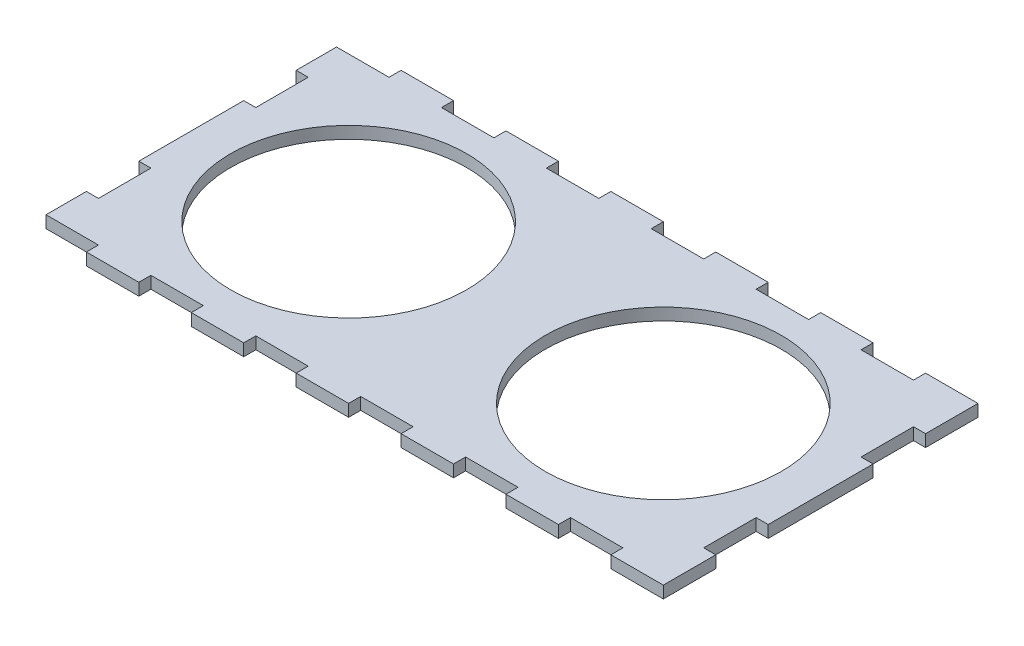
ISO-10303-21;
HEADER;
FILE_DESCRIPTION(('STEP AP214'),'2;1');
FILE_NAME('part.step','',(''),(''),'','','');
FILE_SCHEMA(('AUTOMOTIVE_DESIGN { 1 0 10303 214 1 1 1 1 }'));
ENDSEC;
DATA;
#1=APPLICATION_CONTEXT('core data for automotive mechanical design processes');
#2=APPLICATION_PROTOCOL_DEFINITION('international standard','automotive_design',2000,#1);
#3=PRODUCT_CONTEXT('',#1,'mechanical');
#4=PRODUCT('Part','Part','',(#3));
#5=PRODUCT_RELATED_PRODUCT_CATEGORY('part','',(#4));
#6=PRODUCT_DEFINITION_FORMATION('','',#4);
#7=PRODUCT_DEFINITION_CONTEXT('part definition',#1,'design');
#8=PRODUCT_DEFINITION('design','',#6,#7);
#9=PRODUCT_DEFINITION_SHAPE('','',#8);
#10=(LENGTH_UNIT() NAMED_UNIT(*) SI_UNIT(.MILLI.,.METRE.));
#11=(NAMED_UNIT(*) PLANE_ANGLE_UNIT() SI_UNIT($,.RADIAN.));
#12=(NAMED_UNIT(*) SI_UNIT($,.STERADIAN.) SOLID_ANGLE_UNIT());
#13=UNCERTAINTY_MEASURE_WITH_UNIT(LENGTH_MEASURE(1.E-05),#10,'distance_accuracy_value','');
#14=(GEOMETRIC_REPRESENTATION_CONTEXT(3) GLOBAL_UNCERTAINTY_ASSIGNED_CONTEXT((#13)) GLOBAL_UNIT_ASSIGNED_CONTEXT((#10,
#11,#12)) REPRESENTATION_CONTEXT('',''));
#15=CARTESIAN_POINT('',(0.,0.,0.));
#16=DIRECTION('',(0.,0.,1.));
#17=DIRECTION('',(1.,0.,0.));
#18=AXIS2_PLACEMENT_3D('',#15,#16,#17);
#19=CARTESIAN_POINT('',(0.,5.842,0.));
#20=DIRECTION('',(0.,1.,0.));
#21=DIRECTION('',(0.,0.,1.));
#22=AXIS2_PLACEMENT_3D('',#19,#20,#21);
#23=PLANE('',#22);
#24=CARTESIAN_POINT('',(0.,5.842,0.));
#25=DIRECTION('',(0.,1.,0.));
#26=DIRECTION('',(0.,0.,1.));
#27=AXIS2_PLACEMENT_3D('',#24,#25,#26);
#28=CIRCLE('',#27,57.15);
#29=CARTESIAN_POINT('',(0.,5.842,57.15));
#30=VERTEX_POINT('',#29);
#31=EDGE_CURVE('E470',#30,#30,#28,.T.);
#32=ORIENTED_EDGE('',*,*,#31,.F.);
#33=EDGE_LOOP('',(#32));
#34=FACE_BOUND('',#33,.T.);
#35=DIRECTION('',(0.,0.,1.));
#36=VECTOR('',#35,1.);
#37=CARTESIAN_POINT('',(50.8,5.842,70.358));
#38=LINE('',#37,#36);
#39=CARTESIAN_POINT('',(50.8,5.842,70.358));
#40=VERTEX_POINT('',#39);
#41=CARTESIAN_POINT('',(50.7999999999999,5.842,76.2));
#42=VERTEX_POINT('',#41);
#43=EDGE_CURVE('E593',#40,#42,#38,.T.);
#44=ORIENTED_EDGE('',*,*,#43,.T.);
#45=DIRECTION('',(1.,0.,0.));
#46=VECTOR('',#45,1.);
#47=CARTESIAN_POINT('',(50.7999999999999,5.842,76.2));
#48=LINE('',#47,#46);
#49=CARTESIAN_POINT('',(76.2,5.842,76.2));
#50=VERTEX_POINT('',#49);
#51=EDGE_CURVE('E261',#42,#50,#48,.T.);
#52=ORIENTED_EDGE('',*,*,#51,.T.);
#53=DIRECTION('',(0.,0.,-1.));
#54=VECTOR('',#53,1.);
#55=CARTESIAN_POINT('',(76.1999999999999,5.842,50.8000000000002));
#56=LINE('',#55,#54);
#57=CARTESIAN_POINT('',(76.1999999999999,5.842,50.8000000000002));
#58=VERTEX_POINT('',#57);
#59=EDGE_CURVE('E776',#50,#58,#56,.T.);
#60=ORIENTED_EDGE('',*,*,#59,.T.);
#61=DIRECTION('',(-1.,0.,0.));
#62=VECTOR('',#61,1.);
#63=CARTESIAN_POINT('',(76.1999999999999,5.842,50.8000000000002));
#64=LINE('',#63,#62);
#65=CARTESIAN_POINT('',(70.358,5.842,50.8));
#66=VERTEX_POINT('',#65);
#67=EDGE_CURVE('E795',#58,#66,#64,.T.);
#68=ORIENTED_EDGE('',*,*,#67,.T.);
#69=DIRECTION('',(0.,0.,-1.));
#70=VECTOR('',#69,1.);
#71=CARTESIAN_POINT('',(70.358,5.842,50.8));
#72=LINE('',#71,#70);
#73=CARTESIAN_POINT('',(70.3579999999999,5.842,25.4));
#74=VERTEX_POINT('',#73);
#75=EDGE_CURVE('E792',#66,#74,#72,.T.);
#76=ORIENTED_EDGE('',*,*,#75,.T.);
#77=DIRECTION('',(1.,0.,0.));
#78=VECTOR('',#77,1.);
#79=CARTESIAN_POINT('',(70.3579999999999,5.842,25.4));
#80=LINE('',#79,#78);
#81=CARTESIAN_POINT('',(76.1999999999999,5.842,25.4000000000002));
#82=VERTEX_POINT('',#81);
#83=EDGE_CURVE('E794',#74,#82,#80,.T.);
#84=ORIENTED_EDGE('',*,*,#83,.T.);
#85=DIRECTION('',(0.,0.,-1.));
#86=VECTOR('',#85,1.);
#87=CARTESIAN_POINT('',(76.2000000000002,5.842,-25.3999999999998));
#88=LINE('',#87,#86);
#89=CARTESIAN_POINT('',(76.2000000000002,5.842,-25.3999999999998));
#90=VERTEX_POINT('',#89);
#91=EDGE_CURVE('E797',#82,#90,#88,.T.);
#92=ORIENTED_EDGE('',*,*,#91,.T.);
#93=DIRECTION('',(-1.,0.,0.));
#94=VECTOR('',#93,1.);
#95=CARTESIAN_POINT('',(76.2000000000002,5.842,-25.3999999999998));
#96=LINE('',#95,#94);
#97=CARTESIAN_POINT('',(70.3579999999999,5.842,-25.4));
#98=VERTEX_POINT('',#97);
#99=EDGE_CURVE('E803',#90,#98,#96,.T.);
#100=ORIENTED_EDGE('',*,*,#99,.T.);
#101=DIRECTION('',(0.,0.,-1.));
#102=VECTOR('',#101,1.);
#103=CARTESIAN_POINT('',(70.3579999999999,5.842,-25.4));
#104=LINE('',#103,#102);
#105=CARTESIAN_POINT('',(70.358,5.842,-50.8));
#106=VERTEX_POINT('',#105);
#107=EDGE_CURVE('E805',#98,#106,#104,.T.);
#108=ORIENTED_EDGE('',*,*,#107,.T.);
#109=DIRECTION('',(1.,0.,0.));
#110=VECTOR('',#109,1.);
#111=CARTESIAN_POINT('',(70.358,5.842,-50.8));
#112=LINE('',#111,#110);
#113=CARTESIAN_POINT('',(76.2000000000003,5.842,-50.7999999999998));
#114=VERTEX_POINT('',#113);
#115=EDGE_CURVE('E807',#106,#114,#112,.T.);
#116=ORIENTED_EDGE('',*,*,#115,.T.);
#117=DIRECTION('',(0.,0.,-1.));
#118=VECTOR('',#117,1.);
#119=CARTESIAN_POINT('',(76.2,5.842,-76.2));
#120=LINE('',#119,#118);
#121=CARTESIAN_POINT('',(76.2,5.842,-76.2));
#122=VERTEX_POINT('',#121);
#123=EDGE_CURVE('E809',#114,#122,#120,.T.);
#124=ORIENTED_EDGE('',*,*,#123,.T.);
#125=DIRECTION('',(-1.,0.,0.));
#126=VECTOR('',#125,1.);
#127=CARTESIAN_POINT('',(50.8,5.842,-76.2));
#128=LINE('',#127,#126);
#129=CARTESIAN_POINT('',(50.8,5.842,-76.2));
#130=VERTEX_POINT('',#129);
#131=EDGE_CURVE('E811',#122,#130,#128,.T.);
#132=ORIENTED_EDGE('',*,*,#131,.T.);
#133=DIRECTION('',(0.,0.,1.));
#134=VECTOR('',#133,1.);
#135=CARTESIAN_POINT('',(50.8,5.842,-70.358));
#136=LINE('',#135,#134);
#137=CARTESIAN_POINT('',(50.8,5.842,-70.358));
#138=VERTEX_POINT('',#137);
#139=EDGE_CURVE('E813',#130,#138,#136,.T.);
#140=ORIENTED_EDGE('',*,*,#139,.T.);
#141=DIRECTION('',(-1.,0.,0.));
#142=VECTOR('',#141,1.);
#143=CARTESIAN_POINT('',(25.3999999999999,5.842,-70.358));
#144=LINE('',#143,#142);
#145=CARTESIAN_POINT('',(25.3999999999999,5.842,-70.358));
#146=VERTEX_POINT('',#145);
#147=EDGE_CURVE('E815',#138,#146,#144,.T.);
#148=ORIENTED_EDGE('',*,*,#147,.T.);
#149=DIRECTION('',(0.,0.,-1.));
#150=VECTOR('',#149,1.);
#151=CARTESIAN_POINT('',(25.4,5.842,-76.2));
#152=LINE('',#151,#150);
#153=CARTESIAN_POINT('',(25.4,5.842,-76.2));
#154=VERTEX_POINT('',#153);
#155=EDGE_CURVE('E817',#146,#154,#152,.T.);
#156=ORIENTED_EDGE('',*,*,#155,.T.);
#157=DIRECTION('',(-1.,0.,0.));
#158=VECTOR('',#157,1.);
#159=CARTESIAN_POINT('',(0.,5.842,-76.2));
#160=LINE('',#159,#158);
#161=CARTESIAN_POINT('',(0.,5.842,-76.2));
#162=VERTEX_POINT('',#161);
#163=EDGE_CURVE('E819',#154,#162,#160,.T.);
#164=ORIENTED_EDGE('',*,*,#163,.T.);
#165=DIRECTION('',(0.,0.,1.));
#166=VECTOR('',#165,1.);
#167=CARTESIAN_POINT('',(0.,5.842,-70.358));
#168=LINE('',#167,#166);
#169=CARTESIAN_POINT('',(0.,5.842,-70.358));
#170=VERTEX_POINT('',#169);
#171=EDGE_CURVE('E821',#162,#170,#168,.T.);
#172=ORIENTED_EDGE('',*,*,#171,.T.);
#173=DIRECTION('',(-1.,0.,0.));
#174=VECTOR('',#173,1.);
#175=CARTESIAN_POINT('',(-25.4,5.842,-70.358));
#176=LINE('',#175,#174);
#177=CARTESIAN_POINT('',(-25.4,5.842,-70.358));
#178=VERTEX_POINT('',#177);
#179=EDGE_CURVE('E823',#170,#178,#176,.T.);
#180=ORIENTED_EDGE('',*,*,#179,.T.);
#181=DIRECTION('',(0.,0.,-1.));
#182=VECTOR('',#181,1.);
#183=CARTESIAN_POINT('',(-25.4,5.842,-76.2));
#184=LINE('',#183,#182);
#185=CARTESIAN_POINT('',(-25.4,5.842,-76.2));
#186=VERTEX_POINT('',#185);
#187=EDGE_CURVE('E825',#178,#186,#184,.T.);
#188=ORIENTED_EDGE('',*,*,#187,.T.);
#189=DIRECTION('',(-1.,0.,0.));
#190=VECTOR('',#189,1.);
#191=CARTESIAN_POINT('',(-50.8,5.842,-76.2));
#192=LINE('',#191,#190);
#193=CARTESIAN_POINT('',(-50.8,5.842,-76.2));
#194=VERTEX_POINT('',#193);
#195=EDGE_CURVE('E827',#186,#194,#192,.T.);
#196=ORIENTED_EDGE('',*,*,#195,.T.);
#197=DIRECTION('',(0.,0.,1.));
#198=VECTOR('',#197,1.);
#199=CARTESIAN_POINT('',(-50.8,5.842,-70.358));
#200=LINE('',#199,#198);
#201=CARTESIAN_POINT('',(-50.8,5.842,-70.358));
#202=VERTEX_POINT('',#201);
#203=EDGE_CURVE('E829',#194,#202,#200,.T.);
#204=ORIENTED_EDGE('',*,*,#203,.T.);
#205=DIRECTION('',(-1.,0.,0.));
#206=VECTOR('',#205,1.);
#207=CARTESIAN_POINT('',(-76.2,5.842,-70.358));
#208=LINE('',#207,#206);
#209=CARTESIAN_POINT('',(-76.2,5.842,-70.358));
#210=VERTEX_POINT('',#209);
#211=EDGE_CURVE('E831',#202,#210,#208,.T.);
#212=ORIENTED_EDGE('',*,*,#211,.T.);
#213=DIRECTION('',(0.,0.,-1.));
#214=VECTOR('',#213,1.);
#215=CARTESIAN_POINT('',(-76.2,5.842,-76.2));
#216=LINE('',#215,#214);
#217=CARTESIAN_POINT('',(-76.2,5.842,-76.2));
#218=VERTEX_POINT('',#217);
#219=EDGE_CURVE('E833',#210,#218,#216,.T.);
#220=ORIENTED_EDGE('',*,*,#219,.T.);
#221=DIRECTION('',(-1.,0.,0.));
#222=VECTOR('',#221,1.);
#223=CARTESIAN_POINT('',(-101.6,5.842,-76.2));
#224=LINE('',#223,#222);
#225=CARTESIAN_POINT('',(-101.6,5.842,-76.2));
#226=VERTEX_POINT('',#225);
#227=EDGE_CURVE('E835',#218,#226,#224,.T.);
#228=ORIENTED_EDGE('',*,*,#227,.T.);
#229=DIRECTION('',(0.,0.,1.));
#230=VECTOR('',#229,1.);
#231=CARTESIAN_POINT('',(-101.6,5.842,-70.358));
#232=LINE('',#231,#230);
#233=CARTESIAN_POINT('',(-101.6,5.842,-70.358));
#234=VERTEX_POINT('',#233);
#235=EDGE_CURVE('E837',#226,#234,#232,.T.);
#236=ORIENTED_EDGE('',*,*,#235,.T.);
#237=DIRECTION('',(-1.,0.,0.));
#238=VECTOR('',#237,1.);
#239=CARTESIAN_POINT('',(-127.,5.842,-70.358));
#240=LINE('',#239,#238);
#241=CARTESIAN_POINT('',(-127.,5.842,-70.358));
#242=VERTEX_POINT('',#241);
#243=EDGE_CURVE('E839',#234,#242,#240,.T.);
#244=ORIENTED_EDGE('',*,*,#243,.T.);
#245=DIRECTION('',(0.,0.,-1.));
#246=VECTOR('',#245,1.);
#247=CARTESIAN_POINT('',(-127.,5.842,-76.2));
#248=LINE('',#247,#246);
#249=CARTESIAN_POINT('',(-127.,5.842,-76.2));
#250=VERTEX_POINT('',#249);
#251=EDGE_CURVE('E841',#242,#250,#248,.T.);
#252=ORIENTED_EDGE('',*,*,#251,.T.);
#253=DIRECTION('',(-1.,0.,0.));
#254=VECTOR('',#253,1.);
#255=CARTESIAN_POINT('',(-152.4,5.842,-76.2));
#256=LINE('',#255,#254);
#257=CARTESIAN_POINT('',(-152.4,5.842,-76.2));
#258=VERTEX_POINT('',#257);
#259=EDGE_CURVE('E843',#250,#258,#256,.T.);
#260=ORIENTED_EDGE('',*,*,#259,.T.);
#261=DIRECTION('',(0.,0.,1.));
#262=VECTOR('',#261,1.);
#263=CARTESIAN_POINT('',(-152.4,5.842,-70.358));
#264=LINE('',#263,#262);
#265=CARTESIAN_POINT('',(-152.4,5.842,-70.358));
#266=VERTEX_POINT('',#265);
#267=EDGE_CURVE('E845',#258,#266,#264,.T.);
#268=ORIENTED_EDGE('',*,*,#267,.T.);
#269=DIRECTION('',(-1.,0.,0.));
#270=VECTOR('',#269,1.);
#271=CARTESIAN_POINT('',(-177.8,5.842,-70.358));
#272=LINE('',#271,#270);
#273=CARTESIAN_POINT('',(-177.8,5.842,-70.358));
#274=VERTEX_POINT('',#273);
#275=EDGE_CURVE('E847',#266,#274,#272,.T.);
#276=ORIENTED_EDGE('',*,*,#275,.T.);
#277=DIRECTION('',(0.,0.,-1.));
#278=VECTOR('',#277,1.);
#279=CARTESIAN_POINT('',(-177.8,5.842,-76.2));
#280=LINE('',#279,#278);
#281=CARTESIAN_POINT('',(-177.8,5.842,-76.2));
#282=VERTEX_POINT('',#281);
#283=EDGE_CURVE('E849',#274,#282,#280,.T.);
#284=ORIENTED_EDGE('',*,*,#283,.T.);
#285=DIRECTION('',(-1.,0.,0.));
#286=VECTOR('',#285,1.);
#287=CARTESIAN_POINT('',(-203.2,5.842,-76.2));
#288=LINE('',#287,#286);
#289=CARTESIAN_POINT('',(-203.2,5.842,-76.2));
#290=VERTEX_POINT('',#289);
#291=EDGE_CURVE('E851',#282,#290,#288,.T.);
#292=ORIENTED_EDGE('',*,*,#291,.T.);
#293=DIRECTION('',(0.,0.,1.));
#294=VECTOR('',#293,1.);
#295=CARTESIAN_POINT('',(-203.2,5.842,-70.358));
#296=LINE('',#295,#294);
#297=CARTESIAN_POINT('',(-203.2,5.842,-70.358));
#298=VERTEX_POINT('',#297);
#299=EDGE_CURVE('E853',#290,#298,#296,.T.);
#300=ORIENTED_EDGE('',*,*,#299,.T.);
#301=DIRECTION('',(-1.,0.,0.));
#302=VECTOR('',#301,1.);
#303=CARTESIAN_POINT('',(-228.6,5.842,-70.358));
#304=LINE('',#303,#302);
#305=CARTESIAN_POINT('',(-228.6,5.842,-70.358));
#306=VERTEX_POINT('',#305);
#307=EDGE_CURVE('E855',#298,#306,#304,.T.);
#308=ORIENTED_EDGE('',*,*,#307,.T.);
#309=DIRECTION('',(0.,0.,1.));
#310=VECTOR('',#309,1.);
#311=CARTESIAN_POINT('',(-228.6,5.842,-70.358));
#312=LINE('',#311,#310);
#313=CARTESIAN_POINT('',(-228.6,5.842,-50.8));
#314=VERTEX_POINT('',#313);
#315=EDGE_CURVE('E857',#306,#314,#312,.T.);
#316=ORIENTED_EDGE('',*,*,#315,.T.);
#317=DIRECTION('',(1.,0.,0.));
#318=VECTOR('',#317,1.);
#319=CARTESIAN_POINT('',(-222.758,5.842,-50.8));
#320=LINE('',#319,#318);
#321=CARTESIAN_POINT('',(-222.758,5.842,-50.8));
#322=VERTEX_POINT('',#321);
#323=EDGE_CURVE('E859',#314,#322,#320,.T.);
#324=ORIENTED_EDGE('',*,*,#323,.T.);
#325=DIRECTION('',(0.,0.,1.));
#326=VECTOR('',#325,1.);
#327=CARTESIAN_POINT('',(-222.758,5.842,-25.4));
#328=LINE('',#327,#326);
#329=CARTESIAN_POINT('',(-222.758,5.842,-25.4));
#330=VERTEX_POINT('',#329);
#331=EDGE_CURVE('E861',#322,#330,#328,.T.);
#332=ORIENTED_EDGE('',*,*,#331,.T.);
#333=DIRECTION('',(-1.,0.,0.));
#334=VECTOR('',#333,1.);
#335=CARTESIAN_POINT('',(-228.6,5.842,-25.4));
#336=LINE('',#335,#334);
#337=CARTESIAN_POINT('',(-228.6,5.842,-25.4));
#338=VERTEX_POINT('',#337);
#339=EDGE_CURVE('E863',#330,#338,#336,.T.);
#340=ORIENTED_EDGE('',*,*,#339,.T.);
#341=DIRECTION('',(0.,0.,1.));
#342=VECTOR('',#341,1.);
#343=CARTESIAN_POINT('',(-228.6,5.842,-25.4));
#344=LINE('',#343,#342);
#345=CARTESIAN_POINT('',(-228.6,5.842,25.4));
#346=VERTEX_POINT('',#345);
#347=EDGE_CURVE('E865',#338,#346,#344,.T.);
#348=ORIENTED_EDGE('',*,*,#347,.T.);
#349=DIRECTION('',(1.,0.,0.));
#350=VECTOR('',#349,1.);
#351=CARTESIAN_POINT('',(-222.758,5.842,25.4));
#352=LINE('',#351,#350);
#353=CARTESIAN_POINT('',(-222.758,5.842,25.4));
#354=VERTEX_POINT('',#353);
#355=EDGE_CURVE('E867',#346,#354,#352,.T.);
#356=ORIENTED_EDGE('',*,*,#355,.T.);
#357=DIRECTION('',(0.,0.,1.));
#358=VECTOR('',#357,1.);
#359=CARTESIAN_POINT('',(-222.758,5.842,50.8));
#360=LINE('',#359,#358);
#361=CARTESIAN_POINT('',(-222.758,5.842,50.8));
#362=VERTEX_POINT('',#361);
#363=EDGE_CURVE('E869',#354,#362,#360,.T.);
#364=ORIENTED_EDGE('',*,*,#363,.T.);
#365=DIRECTION('',(-1.,0.,0.));
#366=VECTOR('',#365,1.);
#367=CARTESIAN_POINT('',(-228.6,5.842,50.8));
#368=LINE('',#367,#366);
#369=CARTESIAN_POINT('',(-228.6,5.842,50.8));
#370=VERTEX_POINT('',#369);
#371=EDGE_CURVE('E871',#362,#370,#368,.T.);
#372=ORIENTED_EDGE('',*,*,#371,.T.);
#373=DIRECTION('',(0.,0.,1.));
#374=VECTOR('',#373,1.);
#375=CARTESIAN_POINT('',(-228.6,5.842,50.8));
#376=LINE('',#375,#374);
#377=CARTESIAN_POINT('',(-228.6,5.842,70.358));
#378=VERTEX_POINT('',#377);
#379=EDGE_CURVE('E873',#370,#378,#376,.T.);
#380=ORIENTED_EDGE('',*,*,#379,.T.);
#381=DIRECTION('',(1.,0.,0.));
#382=VECTOR('',#381,1.);
#383=CARTESIAN_POINT('',(-228.6,5.842,70.358));
#384=LINE('',#383,#382);
#385=CARTESIAN_POINT('',(-203.2,5.842,70.358));
#386=VERTEX_POINT('',#385);
#387=EDGE_CURVE('E875',#378,#386,#384,.T.);
#388=ORIENTED_EDGE('',*,*,#387,.T.);
#389=DIRECTION('',(0.,0.,1.));
#390=VECTOR('',#389,1.);
#391=CARTESIAN_POINT('',(-203.2,5.842,70.358));
#392=LINE('',#391,#390);
#393=CARTESIAN_POINT('',(-203.2,5.842,76.2));
#394=VERTEX_POINT('',#393);
#395=EDGE_CURVE('E877',#386,#394,#392,.T.);
#396=ORIENTED_EDGE('',*,*,#395,.T.);
#397=DIRECTION('',(1.,0.,0.));
#398=VECTOR('',#397,1.);
#399=CARTESIAN_POINT('',(-203.2,5.842,76.2));
#400=LINE('',#399,#398);
#401=CARTESIAN_POINT('',(-177.8,5.842,76.2));
#402=VERTEX_POINT('',#401);
#403=EDGE_CURVE('E879',#394,#402,#400,.T.);
#404=ORIENTED_EDGE('',*,*,#403,.T.);
#405=DIRECTION('',(0.,0.,-1.));
#406=VECTOR('',#405,1.);
#407=CARTESIAN_POINT('',(-177.8,5.842,76.2));
#408=LINE('',#407,#406);
#409=CARTESIAN_POINT('',(-177.8,5.842,70.358));
#410=VERTEX_POINT('',#409);
#411=EDGE_CURVE('E881',#402,#410,#408,.T.);
#412=ORIENTED_EDGE('',*,*,#411,.T.);
#413=DIRECTION('',(1.,0.,0.));
#414=VECTOR('',#413,1.);
#415=CARTESIAN_POINT('',(-177.8,5.842,70.358));
#416=LINE('',#415,#414);
#417=CARTESIAN_POINT('',(-152.4,5.842,70.358));
#418=VERTEX_POINT('',#417);
#419=EDGE_CURVE('E883',#410,#418,#416,.T.);
#420=ORIENTED_EDGE('',*,*,#419,.T.);
#421=DIRECTION('',(0.,0.,1.));
#422=VECTOR('',#421,1.);
#423=CARTESIAN_POINT('',(-152.4,5.842,70.358));
#424=LINE('',#423,#422);
#425=CARTESIAN_POINT('',(-152.4,5.842,76.2));
#426=VERTEX_POINT('',#425);
#427=EDGE_CURVE('E885',#418,#426,#424,.T.);
#428=ORIENTED_EDGE('',*,*,#427,.T.);
#429=DIRECTION('',(1.,0.,0.));
#430=VECTOR('',#429,1.);
#431=CARTESIAN_POINT('',(-152.4,5.842,76.2));
#432=LINE('',#431,#430);
#433=CARTESIAN_POINT('',(-127.,5.842,76.2));
#434=VERTEX_POINT('',#433);
#435=EDGE_CURVE('E887',#426,#434,#432,.T.);
#436=ORIENTED_EDGE('',*,*,#435,.T.);
#437=DIRECTION('',(0.,0.,-1.));
#438=VECTOR('',#437,1.);
#439=CARTESIAN_POINT('',(-127.,5.842,76.2));
#440=LINE('',#439,#438);
#441=CARTESIAN_POINT('',(-127.,5.842,70.358));
#442=VERTEX_POINT('',#441);
#443=EDGE_CURVE('E889',#434,#442,#440,.T.);
#444=ORIENTED_EDGE('',*,*,#443,.T.);
#445=DIRECTION('',(1.,0.,0.));
#446=VECTOR('',#445,1.);
#447=CARTESIAN_POINT('',(-127.,5.842,70.358));
#448=LINE('',#447,#446);
#449=CARTESIAN_POINT('',(-101.6,5.842,70.358));
#450=VERTEX_POINT('',#449);
#451=EDGE_CURVE('E891',#442,#450,#448,.T.);
#452=ORIENTED_EDGE('',*,*,#451,.T.);
#453=DIRECTION('',(0.,0.,1.));
#454=VECTOR('',#453,1.);
#455=CARTESIAN_POINT('',(-101.6,5.842,70.358));
#456=LINE('',#455,#454);
#457=CARTESIAN_POINT('',(-101.6,5.842,76.2));
#458=VERTEX_POINT('',#457);
#459=EDGE_CURVE('E893',#450,#458,#456,.T.);
#460=ORIENTED_EDGE('',*,*,#459,.T.);
#461=DIRECTION('',(1.,0.,0.));
#462=VECTOR('',#461,1.);
#463=CARTESIAN_POINT('',(-101.6,5.842,76.2));
#464=LINE('',#463,#462);
#465=CARTESIAN_POINT('',(-76.2000000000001,5.842,76.2));
#466=VERTEX_POINT('',#465);
#467=EDGE_CURVE('E895',#458,#466,#464,.T.);
#468=ORIENTED_EDGE('',*,*,#467,.T.);
#469=DIRECTION('',(0.,0.,-1.));
#470=VECTOR('',#469,1.);
#471=CARTESIAN_POINT('',(-76.2000000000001,5.842,76.2));
#472=LINE('',#471,#470);
#473=CARTESIAN_POINT('',(-76.2,5.842,70.358));
#474=VERTEX_POINT('',#473);
#475=EDGE_CURVE('E897',#466,#474,#472,.T.);
#476=ORIENTED_EDGE('',*,*,#475,.T.);
#477=DIRECTION('',(1.,0.,0.));
#478=VECTOR('',#477,1.);
#479=CARTESIAN_POINT('',(-76.2,5.842,70.358));
#480=LINE('',#479,#478);
#481=CARTESIAN_POINT('',(-50.8,5.842,70.358));
#482=VERTEX_POINT('',#481);
#483=EDGE_CURVE('E899',#474,#482,#480,.T.);
#484=ORIENTED_EDGE('',*,*,#483,.T.);
#485=DIRECTION('',(0.,0.,1.));
#486=VECTOR('',#485,1.);
#487=CARTESIAN_POINT('',(-50.8,5.842,70.358));
#488=LINE('',#487,#486);
#489=CARTESIAN_POINT('',(-50.8000000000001,5.842,76.2));
#490=VERTEX_POINT('',#489);
#491=EDGE_CURVE('E901',#482,#490,#488,.T.);
#492=ORIENTED_EDGE('',*,*,#491,.T.);
#493=DIRECTION('',(1.,0.,0.));
#494=VECTOR('',#493,1.);
#495=CARTESIAN_POINT('',(-50.8000000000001,5.842,76.2));
#496=LINE('',#495,#494);
#497=CARTESIAN_POINT('',(-25.4000000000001,5.842,76.2));
#498=VERTEX_POINT('',#497);
#499=EDGE_CURVE('E903',#490,#498,#496,.T.);
#500=ORIENTED_EDGE('',*,*,#499,.T.);
#501=DIRECTION('',(0.,0.,-1.));
#502=VECTOR('',#501,1.);
#503=CARTESIAN_POINT('',(-25.4000000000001,5.842,76.2));
#504=LINE('',#503,#502);
#505=CARTESIAN_POINT('',(-25.4,5.842,70.358));
#506=VERTEX_POINT('',#505);
#507=EDGE_CURVE('E905',#498,#506,#504,.T.);
#508=ORIENTED_EDGE('',*,*,#507,.T.);
#509=DIRECTION('',(1.,0.,0.));
#510=VECTOR('',#509,1.);
#511=CARTESIAN_POINT('',(-25.4,5.842,70.358));
#512=LINE('',#511,#510);
#513=CARTESIAN_POINT('',(0.,5.842,70.358));
#514=VERTEX_POINT('',#513);
#515=EDGE_CURVE('E907',#506,#514,#512,.T.);
#516=ORIENTED_EDGE('',*,*,#515,.T.);
#517=DIRECTION('',(0.,0.,1.));
#518=VECTOR('',#517,1.);
#519=CARTESIAN_POINT('',(0.,5.842,70.358));
#520=LINE('',#519,#518);
#521=CARTESIAN_POINT('',(-1.38777878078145E-13,5.842,76.2));
#522=VERTEX_POINT('',#521);
#523=EDGE_CURVE('E448',#514,#522,#520,.T.);
#524=ORIENTED_EDGE('',*,*,#523,.T.);
#525=DIRECTION('',(1.,0.,0.));
#526=VECTOR('',#525,1.);
#527=CARTESIAN_POINT('',(-1.38777878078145E-13,5.842,76.2));
#528=LINE('',#527,#526);
#529=CARTESIAN_POINT('',(25.3999999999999,5.842,76.2));
#530=VERTEX_POINT('',#529);
#531=EDGE_CURVE('E442',#522,#530,#528,.T.);
#532=ORIENTED_EDGE('',*,*,#531,.T.);
#533=DIRECTION('',(0.,0.,-1.));
#534=VECTOR('',#533,1.);
#535=CARTESIAN_POINT('',(25.3999999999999,5.842,76.2));
#536=LINE('',#535,#534);
#537=CARTESIAN_POINT('',(25.3999999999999,5.842,70.358));
#538=VERTEX_POINT('',#537);
#539=EDGE_CURVE('E446',#530,#538,#536,.T.);
#540=ORIENTED_EDGE('',*,*,#539,.T.);
#541=DIRECTION('',(1.,0.,0.));
#542=VECTOR('',#541,1.);
#543=CARTESIAN_POINT('',(25.3999999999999,5.842,70.358));
#544=LINE('',#543,#542);
#545=EDGE_CURVE('E50',#538,#40,#544,.T.);
#546=ORIENTED_EDGE('',*,*,#545,.T.);
#547=EDGE_LOOP('',(#44,#52,#60,#68,#76,#84,#92,#100,#108,#116,#124,#132,#140,#148,#156,#164,
#172,#180,#188,#196,#204,#212,#220,#228,#236,#244,#252,#260,#268,#276,#284,#292,#300,#308,#316,
#324,#332,#340,#348,#356,#364,#372,#380,#388,#396,#404,#412,#420,#428,#436,#444,#452,#460,#468,
#476,#484,#492,#500,#508,#516,#524,#532,#540,#546));
#548=FACE_BOUND('',#547,.T.);
#549=CARTESIAN_POINT('',(-152.4,5.842,0.));
#550=DIRECTION('',(0.,1.,0.));
#551=DIRECTION('',(0.,0.,1.));
#552=AXIS2_PLACEMENT_3D('',#549,#550,#551);
#553=CIRCLE('',#552,57.15);
#554=CARTESIAN_POINT('',(-152.4,5.842,57.15));
#555=VERTEX_POINT('',#554);
#556=EDGE_CURVE('E949',#555,#555,#553,.T.);
#557=ORIENTED_EDGE('',*,*,#556,.F.);
#558=EDGE_LOOP('',(#557));
#559=FACE_BOUND('',#558,.T.);
#560=ADVANCED_FACE('F33',(#34,#548,#559),#23,.T.);
#561=CARTESIAN_POINT('',(0.,0.,0.));
#562=DIRECTION('',(0.,1.,0.));
#563=DIRECTION('',(0.,0.,1.));
#564=AXIS2_PLACEMENT_3D('',#561,#562,#563);
#565=PLANE('',#564);
#566=DIRECTION('',(0.,0.,1.));
#567=VECTOR('',#566,1.);
#568=CARTESIAN_POINT('',(50.8,0.,70.358));
#569=LINE('',#568,#567);
#570=CARTESIAN_POINT('',(50.8,0.,70.358));
#571=VERTEX_POINT('',#570);
#572=CARTESIAN_POINT('',(50.7999999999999,0.,76.2));
#573=VERTEX_POINT('',#572);
#574=EDGE_CURVE('E466',#571,#573,#569,.T.);
#575=ORIENTED_EDGE('',*,*,#574,.F.);
#576=DIRECTION('',(1.,0.,0.));
#577=VECTOR('',#576,1.);
#578=CARTESIAN_POINT('',(25.3999999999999,0.,70.358));
#579=LINE('',#578,#577);
#580=CARTESIAN_POINT('',(25.3999999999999,0.,70.358));
#581=VERTEX_POINT('',#580);
#582=EDGE_CURVE('E253',#581,#571,#579,.T.);
#583=ORIENTED_EDGE('',*,*,#582,.F.);
#584=DIRECTION('',(0.,0.,-1.));
#585=VECTOR('',#584,1.);
#586=CARTESIAN_POINT('',(25.3999999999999,0.,76.2));
#587=LINE('',#586,#585);
#588=CARTESIAN_POINT('',(25.3999999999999,0.,76.2));
#589=VERTEX_POINT('',#588);
#590=EDGE_CURVE('E247',#589,#581,#587,.T.);
#591=ORIENTED_EDGE('',*,*,#590,.F.);
#592=DIRECTION('',(1.,0.,0.));
#593=VECTOR('',#592,1.);
#594=CARTESIAN_POINT('',(-1.38777878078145E-13,0.,76.2));
#595=LINE('',#594,#593);
#596=CARTESIAN_POINT('',(-1.38777878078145E-13,0.,76.2));
#597=VERTEX_POINT('',#596);
#598=EDGE_CURVE('E456',#597,#589,#595,.T.);
#599=ORIENTED_EDGE('',*,*,#598,.F.);
#600=DIRECTION('',(0.,0.,1.));
#601=VECTOR('',#600,1.);
#602=CARTESIAN_POINT('',(0.,0.,70.358));
#603=LINE('',#602,#601);
#604=CARTESIAN_POINT('',(0.,0.,70.358));
#605=VERTEX_POINT('',#604);
#606=EDGE_CURVE('E588',#605,#597,#603,.T.);
#607=ORIENTED_EDGE('',*,*,#606,.F.);
#608=DIRECTION('',(1.,0.,0.));
#609=VECTOR('',#608,1.);
#610=CARTESIAN_POINT('',(-25.4,0.,70.358));
#611=LINE('',#610,#609);
#612=CARTESIAN_POINT('',(-25.4,0.,70.358));
#613=VERTEX_POINT('',#612);
#614=EDGE_CURVE('E586',#613,#605,#611,.T.);
#615=ORIENTED_EDGE('',*,*,#614,.F.);
#616=DIRECTION('',(0.,0.,-1.));
#617=VECTOR('',#616,1.);
#618=CARTESIAN_POINT('',(-25.4000000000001,0.,76.2));
#619=LINE('',#618,#617);
#620=CARTESIAN_POINT('',(-25.4000000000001,0.,76.2));
#621=VERTEX_POINT('',#620);
#622=EDGE_CURVE('E584',#621,#613,#619,.T.);
#623=ORIENTED_EDGE('',*,*,#622,.F.);
#624=DIRECTION('',(1.,0.,0.));
#625=VECTOR('',#624,1.);
#626=CARTESIAN_POINT('',(-50.8000000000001,0.,76.2));
#627=LINE('',#626,#625);
#628=CARTESIAN_POINT('',(-50.8000000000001,0.,76.2));
#629=VERTEX_POINT('',#628);
#630=EDGE_CURVE('E582',#629,#621,#627,.T.);
#631=ORIENTED_EDGE('',*,*,#630,.F.);
#632=DIRECTION('',(0.,0.,1.));
#633=VECTOR('',#632,1.);
#634=CARTESIAN_POINT('',(-50.8,0.,70.358));
#635=LINE('',#634,#633);
#636=CARTESIAN_POINT('',(-50.8,0.,70.358));
#637=VERTEX_POINT('',#636);
#638=EDGE_CURVE('E580',#637,#629,#635,.T.);
#639=ORIENTED_EDGE('',*,*,#638,.F.);
#640=DIRECTION('',(1.,0.,0.));
#641=VECTOR('',#640,1.);
#642=CARTESIAN_POINT('',(-76.2,0.,70.358));
#643=LINE('',#642,#641);
#644=CARTESIAN_POINT('',(-76.2,0.,70.358));
#645=VERTEX_POINT('',#644);
#646=EDGE_CURVE('E578',#645,#637,#643,.T.);
#647=ORIENTED_EDGE('',*,*,#646,.F.);
#648=DIRECTION('',(0.,0.,-1.));
#649=VECTOR('',#648,1.);
#650=CARTESIAN_POINT('',(-76.2000000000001,0.,76.2));
#651=LINE('',#650,#649);
#652=CARTESIAN_POINT('',(-76.2000000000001,0.,76.2));
#653=VERTEX_POINT('',#652);
#654=EDGE_CURVE('E576',#653,#645,#651,.T.);
#655=ORIENTED_EDGE('',*,*,#654,.F.);
#656=DIRECTION('',(1.,0.,0.));
#657=VECTOR('',#656,1.);
#658=CARTESIAN_POINT('',(-101.6,0.,76.2));
#659=LINE('',#658,#657);
#660=CARTESIAN_POINT('',(-101.6,0.,76.2));
#661=VERTEX_POINT('',#660);
#662=EDGE_CURVE('E574',#661,#653,#659,.T.);
#663=ORIENTED_EDGE('',*,*,#662,.F.);
#664=DIRECTION('',(0.,0.,1.));
#665=VECTOR('',#664,1.);
#666=CARTESIAN_POINT('',(-101.6,0.,70.358));
#667=LINE('',#666,#665);
#668=CARTESIAN_POINT('',(-101.6,0.,70.358));
#669=VERTEX_POINT('',#668);
#670=EDGE_CURVE('E572',#669,#661,#667,.T.);
#671=ORIENTED_EDGE('',*,*,#670,.F.);
#672=DIRECTION('',(1.,0.,0.));
#673=VECTOR('',#672,1.);
#674=CARTESIAN_POINT('',(-127.,0.,70.358));
#675=LINE('',#674,#673);
#676=CARTESIAN_POINT('',(-127.,0.,70.358));
#677=VERTEX_POINT('',#676);
#678=EDGE_CURVE('E570',#677,#669,#675,.T.);
#679=ORIENTED_EDGE('',*,*,#678,.F.);
#680=DIRECTION('',(0.,0.,-1.));
#681=VECTOR('',#680,1.);
#682=CARTESIAN_POINT('',(-127.,0.,76.2));
#683=LINE('',#682,#681);
#684=CARTESIAN_POINT('',(-127.,0.,76.2));
#685=VERTEX_POINT('',#684);
#686=EDGE_CURVE('E568',#685,#677,#683,.T.);
#687=ORIENTED_EDGE('',*,*,#686,.F.);
#688=DIRECTION('',(1.,0.,0.));
#689=VECTOR('',#688,1.);
#690=CARTESIAN_POINT('',(-152.4,0.,76.2));
#691=LINE('',#690,#689);
#692=CARTESIAN_POINT('',(-152.4,0.,76.2));
#693=VERTEX_POINT('',#692);
#694=EDGE_CURVE('E566',#693,#685,#691,.T.);
#695=ORIENTED_EDGE('',*,*,#694,.F.);
#696=DIRECTION('',(0.,0.,1.));
#697=VECTOR('',#696,1.);
#698=CARTESIAN_POINT('',(-152.4,0.,70.358));
#699=LINE('',#698,#697);
#700=CARTESIAN_POINT('',(-152.4,0.,70.358));
#701=VERTEX_POINT('',#700);
#702=EDGE_CURVE('E564',#701,#693,#699,.T.);
#703=ORIENTED_EDGE('',*,*,#702,.F.);
#704=DIRECTION('',(1.,0.,0.));
#705=VECTOR('',#704,1.);
#706=CARTESIAN_POINT('',(-177.8,0.,70.358));
#707=LINE('',#706,#705);
#708=CARTESIAN_POINT('',(-177.8,0.,70.358));
#709=VERTEX_POINT('',#708);
#710=EDGE_CURVE('E562',#709,#701,#707,.T.);
#711=ORIENTED_EDGE('',*,*,#710,.F.);
#712=DIRECTION('',(0.,0.,-1.));
#713=VECTOR('',#712,1.);
#714=CARTESIAN_POINT('',(-177.8,0.,76.2));
#715=LINE('',#714,#713);
#716=CARTESIAN_POINT('',(-177.8,0.,76.2));
#717=VERTEX_POINT('',#716);
#718=EDGE_CURVE('E560',#717,#709,#715,.T.);
#719=ORIENTED_EDGE('',*,*,#718,.F.);
#720=DIRECTION('',(1.,0.,0.));
#721=VECTOR('',#720,1.);
#722=CARTESIAN_POINT('',(-203.2,0.,76.2));
#723=LINE('',#722,#721);
#724=CARTESIAN_POINT('',(-203.2,0.,76.2));
#725=VERTEX_POINT('',#724);
#726=EDGE_CURVE('E558',#725,#717,#723,.T.);
#727=ORIENTED_EDGE('',*,*,#726,.F.);
#728=DIRECTION('',(0.,0.,1.));
#729=VECTOR('',#728,1.);
#730=CARTESIAN_POINT('',(-203.2,0.,70.358));
#731=LINE('',#730,#729);
#732=CARTESIAN_POINT('',(-203.2,0.,70.358));
#733=VERTEX_POINT('',#732);
#734=EDGE_CURVE('E556',#733,#725,#731,.T.);
#735=ORIENTED_EDGE('',*,*,#734,.F.);
#736=DIRECTION('',(1.,0.,0.));
#737=VECTOR('',#736,1.);
#738=CARTESIAN_POINT('',(-228.6,0.,70.358));
#739=LINE('',#738,#737);
#740=CARTESIAN_POINT('',(-228.6,0.,70.358));
#741=VERTEX_POINT('',#740);
#742=EDGE_CURVE('E554',#741,#733,#739,.T.);
#743=ORIENTED_EDGE('',*,*,#742,.F.);
#744=DIRECTION('',(0.,0.,1.));
#745=VECTOR('',#744,1.);
#746=CARTESIAN_POINT('',(-228.6,0.,50.8));
#747=LINE('',#746,#745);
#748=CARTESIAN_POINT('',(-228.6,0.,50.8));
#749=VERTEX_POINT('',#748);
#750=EDGE_CURVE('E552',#749,#741,#747,.T.);
#751=ORIENTED_EDGE('',*,*,#750,.F.);
#752=DIRECTION('',(-1.,0.,0.));
#753=VECTOR('',#752,1.);
#754=CARTESIAN_POINT('',(-228.6,0.,50.8));
#755=LINE('',#754,#753);
#756=CARTESIAN_POINT('',(-222.758,0.,50.8));
#757=VERTEX_POINT('',#756);
#758=EDGE_CURVE('E550',#757,#749,#755,.T.);
#759=ORIENTED_EDGE('',*,*,#758,.F.);
#760=DIRECTION('',(0.,0.,1.));
#761=VECTOR('',#760,1.);
#762=CARTESIAN_POINT('',(-222.758,0.,50.8));
#763=LINE('',#762,#761);
#764=CARTESIAN_POINT('',(-222.758,0.,25.4));
#765=VERTEX_POINT('',#764);
#766=EDGE_CURVE('E548',#765,#757,#763,.T.);
#767=ORIENTED_EDGE('',*,*,#766,.F.);
#768=DIRECTION('',(1.,0.,0.));
#769=VECTOR('',#768,1.);
#770=CARTESIAN_POINT('',(-222.758,0.,25.4));
#771=LINE('',#770,#769);
#772=CARTESIAN_POINT('',(-228.6,0.,25.4));
#773=VERTEX_POINT('',#772);
#774=EDGE_CURVE('E546',#773,#765,#771,.T.);
#775=ORIENTED_EDGE('',*,*,#774,.F.);
#776=DIRECTION('',(0.,0.,1.));
#777=VECTOR('',#776,1.);
#778=CARTESIAN_POINT('',(-228.6,0.,-25.4));
#779=LINE('',#778,#777);
#780=CARTESIAN_POINT('',(-228.6,0.,-25.4));
#781=VERTEX_POINT('',#780);
#782=EDGE_CURVE('E544',#781,#773,#779,.T.);
#783=ORIENTED_EDGE('',*,*,#782,.F.);
#784=DIRECTION('',(-1.,0.,0.));
#785=VECTOR('',#784,1.);
#786=CARTESIAN_POINT('',(-228.6,0.,-25.4));
#787=LINE('',#786,#785);
#788=CARTESIAN_POINT('',(-222.758,0.,-25.4));
#789=VERTEX_POINT('',#788);
#790=EDGE_CURVE('E542',#789,#781,#787,.T.);
#791=ORIENTED_EDGE('',*,*,#790,.F.);
#792=DIRECTION('',(0.,0.,1.));
#793=VECTOR('',#792,1.);
#794=CARTESIAN_POINT('',(-222.758,0.,-25.4));
#795=LINE('',#794,#793);
#796=CARTESIAN_POINT('',(-222.758,0.,-50.8));
#797=VERTEX_POINT('',#796);
#798=EDGE_CURVE('E540',#797,#789,#795,.T.);
#799=ORIENTED_EDGE('',*,*,#798,.F.);
#800=DIRECTION('',(1.,0.,0.));
#801=VECTOR('',#800,1.);
#802=CARTESIAN_POINT('',(-222.758,0.,-50.8));
#803=LINE('',#802,#801);
#804=CARTESIAN_POINT('',(-228.6,0.,-50.8));
#805=VERTEX_POINT('',#804);
#806=EDGE_CURVE('E538',#805,#797,#803,.T.);
#807=ORIENTED_EDGE('',*,*,#806,.F.);
#808=DIRECTION('',(0.,0.,1.));
#809=VECTOR('',#808,1.);
#810=CARTESIAN_POINT('',(-228.6,0.,-70.358));
#811=LINE('',#810,#809);
#812=CARTESIAN_POINT('',(-228.6,0.,-70.358));
#813=VERTEX_POINT('',#812);
#814=EDGE_CURVE('E536',#813,#805,#811,.T.);
#815=ORIENTED_EDGE('',*,*,#814,.F.);
#816=DIRECTION('',(-1.,0.,0.));
#817=VECTOR('',#816,1.);
#818=CARTESIAN_POINT('',(-228.6,0.,-70.358));
#819=LINE('',#818,#817);
#820=CARTESIAN_POINT('',(-203.2,0.,-70.358));
#821=VERTEX_POINT('',#820);
#822=EDGE_CURVE('E534',#821,#813,#819,.T.);
#823=ORIENTED_EDGE('',*,*,#822,.F.);
#824=DIRECTION('',(0.,0.,1.));
#825=VECTOR('',#824,1.);
#826=CARTESIAN_POINT('',(-203.2,0.,-70.358));
#827=LINE('',#826,#825);
#828=CARTESIAN_POINT('',(-203.2,0.,-76.2));
#829=VERTEX_POINT('',#828);
#830=EDGE_CURVE('E532',#829,#821,#827,.T.);
#831=ORIENTED_EDGE('',*,*,#830,.F.);
#832=DIRECTION('',(-1.,0.,0.));
#833=VECTOR('',#832,1.);
#834=CARTESIAN_POINT('',(-203.2,0.,-76.2));
#835=LINE('',#834,#833);
#836=CARTESIAN_POINT('',(-177.8,0.,-76.2));
#837=VERTEX_POINT('',#836);
#838=EDGE_CURVE('E530',#837,#829,#835,.T.);
#839=ORIENTED_EDGE('',*,*,#838,.F.);
#840=DIRECTION('',(0.,0.,-1.));
#841=VECTOR('',#840,1.);
#842=CARTESIAN_POINT('',(-177.8,0.,-76.2));
#843=LINE('',#842,#841);
#844=CARTESIAN_POINT('',(-177.8,0.,-70.358));
#845=VERTEX_POINT('',#844);
#846=EDGE_CURVE('E528',#845,#837,#843,.T.);
#847=ORIENTED_EDGE('',*,*,#846,.F.);
#848=DIRECTION('',(-1.,0.,0.));
#849=VECTOR('',#848,1.);
#850=CARTESIAN_POINT('',(-177.8,0.,-70.358));
#851=LINE('',#850,#849);
#852=CARTESIAN_POINT('',(-152.4,0.,-70.358));
#853=VERTEX_POINT('',#852);
#854=EDGE_CURVE('E526',#853,#845,#851,.T.);
#855=ORIENTED_EDGE('',*,*,#854,.F.);
#856=DIRECTION('',(0.,0.,1.));
#857=VECTOR('',#856,1.);
#858=CARTESIAN_POINT('',(-152.4,0.,-70.358));
#859=LINE('',#858,#857);
#860=CARTESIAN_POINT('',(-152.4,0.,-76.2));
#861=VERTEX_POINT('',#860);
#862=EDGE_CURVE('E524',#861,#853,#859,.T.);
#863=ORIENTED_EDGE('',*,*,#862,.F.);
#864=DIRECTION('',(-1.,0.,0.));
#865=VECTOR('',#864,1.);
#866=CARTESIAN_POINT('',(-152.4,0.,-76.2));
#867=LINE('',#866,#865);
#868=CARTESIAN_POINT('',(-127.,0.,-76.2));
#869=VERTEX_POINT('',#868);
#870=EDGE_CURVE('E522',#869,#861,#867,.T.);
#871=ORIENTED_EDGE('',*,*,#870,.F.);
#872=DIRECTION('',(0.,0.,-1.));
#873=VECTOR('',#872,1.);
#874=CARTESIAN_POINT('',(-127.,0.,-76.2));
#875=LINE('',#874,#873);
#876=CARTESIAN_POINT('',(-127.,0.,-70.358));
#877=VERTEX_POINT('',#876);
#878=EDGE_CURVE('E520',#877,#869,#875,.T.);
#879=ORIENTED_EDGE('',*,*,#878,.F.);
#880=DIRECTION('',(-1.,0.,0.));
#881=VECTOR('',#880,1.);
#882=CARTESIAN_POINT('',(-127.,0.,-70.358));
#883=LINE('',#882,#881);
#884=CARTESIAN_POINT('',(-101.6,0.,-70.358));
#885=VERTEX_POINT('',#884);
#886=EDGE_CURVE('E518',#885,#877,#883,.T.);
#887=ORIENTED_EDGE('',*,*,#886,.F.);
#888=DIRECTION('',(0.,0.,1.));
#889=VECTOR('',#888,1.);
#890=CARTESIAN_POINT('',(-101.6,0.,-70.358));
#891=LINE('',#890,#889);
#892=CARTESIAN_POINT('',(-101.6,0.,-76.2));
#893=VERTEX_POINT('',#892);
#894=EDGE_CURVE('E516',#893,#885,#891,.T.);
#895=ORIENTED_EDGE('',*,*,#894,.F.);
#896=DIRECTION('',(-1.,0.,0.));
#897=VECTOR('',#896,1.);
#898=CARTESIAN_POINT('',(-101.6,0.,-76.2));
#899=LINE('',#898,#897);
#900=CARTESIAN_POINT('',(-76.2,0.,-76.2));
#901=VERTEX_POINT('',#900);
#902=EDGE_CURVE('E514',#901,#893,#899,.T.);
#903=ORIENTED_EDGE('',*,*,#902,.F.);
#904=DIRECTION('',(0.,0.,-1.));
#905=VECTOR('',#904,1.);
#906=CARTESIAN_POINT('',(-76.2,0.,-76.2));
#907=LINE('',#906,#905);
#908=CARTESIAN_POINT('',(-76.2,0.,-70.358));
#909=VERTEX_POINT('',#908);
#910=EDGE_CURVE('E512',#909,#901,#907,.T.);
#911=ORIENTED_EDGE('',*,*,#910,.F.);
#912=DIRECTION('',(-1.,0.,0.));
#913=VECTOR('',#912,1.);
#914=CARTESIAN_POINT('',(-76.2,0.,-70.358));
#915=LINE('',#914,#913);
#916=CARTESIAN_POINT('',(-50.8,0.,-70.358));
#917=VERTEX_POINT('',#916);
#918=EDGE_CURVE('E510',#917,#909,#915,.T.);
#919=ORIENTED_EDGE('',*,*,#918,.F.);
#920=DIRECTION('',(0.,0.,1.));
#921=VECTOR('',#920,1.);
#922=CARTESIAN_POINT('',(-50.8,0.,-70.358));
#923=LINE('',#922,#921);
#924=CARTESIAN_POINT('',(-50.8,0.,-76.2));
#925=VERTEX_POINT('',#924);
#926=EDGE_CURVE('E508',#925,#917,#923,.T.);
#927=ORIENTED_EDGE('',*,*,#926,.F.);
#928=DIRECTION('',(-1.,0.,0.));
#929=VECTOR('',#928,1.);
#930=CARTESIAN_POINT('',(-50.8,0.,-76.2));
#931=LINE('',#930,#929);
#932=CARTESIAN_POINT('',(-25.4,0.,-76.2));
#933=VERTEX_POINT('',#932);
#934=EDGE_CURVE('E506',#933,#925,#931,.T.);
#935=ORIENTED_EDGE('',*,*,#934,.F.);
#936=DIRECTION('',(0.,0.,-1.));
#937=VECTOR('',#936,1.);
#938=CARTESIAN_POINT('',(-25.4,0.,-76.2));
#939=LINE('',#938,#937);
#940=CARTESIAN_POINT('',(-25.4,0.,-70.358));
#941=VERTEX_POINT('',#940);
#942=EDGE_CURVE('E504',#941,#933,#939,.T.);
#943=ORIENTED_EDGE('',*,*,#942,.F.);
#944=DIRECTION('',(-1.,0.,0.));
#945=VECTOR('',#944,1.);
#946=CARTESIAN_POINT('',(-25.4,0.,-70.358));
#947=LINE('',#946,#945);
#948=CARTESIAN_POINT('',(0.,0.,-70.358));
#949=VERTEX_POINT('',#948);
#950=EDGE_CURVE('E502',#949,#941,#947,.T.);
#951=ORIENTED_EDGE('',*,*,#950,.F.);
#952=DIRECTION('',(0.,0.,1.));
#953=VECTOR('',#952,1.);
#954=CARTESIAN_POINT('',(0.,0.,-70.358));
#955=LINE('',#954,#953);
#956=CARTESIAN_POINT('',(0.,0.,-76.2));
#957=VERTEX_POINT('',#956);
#958=EDGE_CURVE('E500',#957,#949,#955,.T.);
#959=ORIENTED_EDGE('',*,*,#958,.F.);
#960=DIRECTION('',(-1.,0.,0.));
#961=VECTOR('',#960,1.);
#962=CARTESIAN_POINT('',(0.,0.,-76.2));
#963=LINE('',#962,#961);
#964=CARTESIAN_POINT('',(25.4,0.,-76.2));
#965=VERTEX_POINT('',#964);
#966=EDGE_CURVE('E498',#965,#957,#963,.T.);
#967=ORIENTED_EDGE('',*,*,#966,.F.);
#968=DIRECTION('',(0.,0.,-1.));
#969=VECTOR('',#968,1.);
#970=CARTESIAN_POINT('',(25.4,0.,-76.2));
#971=LINE('',#970,#969);
#972=CARTESIAN_POINT('',(25.3999999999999,0.,-70.358));
#973=VERTEX_POINT('',#972);
#974=EDGE_CURVE('E496',#973,#965,#971,.T.);
#975=ORIENTED_EDGE('',*,*,#974,.F.);
#976=DIRECTION('',(-1.,0.,0.));
#977=VECTOR('',#976,1.);
#978=CARTESIAN_POINT('',(25.3999999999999,0.,-70.358));
#979=LINE('',#978,#977);
#980=CARTESIAN_POINT('',(50.8,0.,-70.358));
#981=VERTEX_POINT('',#980);
#982=EDGE_CURVE('E494',#981,#973,#979,.T.);
#983=ORIENTED_EDGE('',*,*,#982,.F.);
#984=DIRECTION('',(0.,0.,1.));
#985=VECTOR('',#984,1.);
#986=CARTESIAN_POINT('',(50.8,0.,-70.358));
#987=LINE('',#986,#985);
#988=CARTESIAN_POINT('',(50.8,0.,-76.2));
#989=VERTEX_POINT('',#988);
#990=EDGE_CURVE('E492',#989,#981,#987,.T.);
#991=ORIENTED_EDGE('',*,*,#990,.F.);
#992=DIRECTION('',(-1.,0.,0.));
#993=VECTOR('',#992,1.);
#994=CARTESIAN_POINT('',(50.8,0.,-76.2));
#995=LINE('',#994,#993);
#996=CARTESIAN_POINT('',(76.2,0.,-76.2));
#997=VERTEX_POINT('',#996);
#998=EDGE_CURVE('E490',#997,#989,#995,.T.);
#999=ORIENTED_EDGE('',*,*,#998,.F.);
#1000=DIRECTION('',(0.,0.,-1.));
#1001=VECTOR('',#1000,1.);
#1002=CARTESIAN_POINT('',(76.2,0.,-76.2));
#1003=LINE('',#1002,#1001);
#1004=CARTESIAN_POINT('',(76.2000000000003,0.,-50.7999999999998));
#1005=VERTEX_POINT('',#1004);
#1006=EDGE_CURVE('E488',#1005,#997,#1003,.T.);
#1007=ORIENTED_EDGE('',*,*,#1006,.F.);
#1008=DIRECTION('',(1.,0.,0.));
#1009=VECTOR('',#1008,1.);
#1010=CARTESIAN_POINT('',(70.358,0.,-50.8));
#1011=LINE('',#1010,#1009);
#1012=CARTESIAN_POINT('',(70.358,0.,-50.8));
#1013=VERTEX_POINT('',#1012);
#1014=EDGE_CURVE('E486',#1013,#1005,#1011,.T.);
#1015=ORIENTED_EDGE('',*,*,#1014,.F.);
#1016=DIRECTION('',(0.,0.,-1.));
#1017=VECTOR('',#1016,1.);
#1018=CARTESIAN_POINT('',(70.3579999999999,0.,-25.4));
#1019=LINE('',#1018,#1017);
#1020=CARTESIAN_POINT('',(70.3579999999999,0.,-25.4));
#1021=VERTEX_POINT('',#1020);
#1022=EDGE_CURVE('E484',#1021,#1013,#1019,.T.);
#1023=ORIENTED_EDGE('',*,*,#1022,.F.);
#1024=DIRECTION('',(-1.,0.,0.));
#1025=VECTOR('',#1024,1.);
#1026=CARTESIAN_POINT('',(76.2000000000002,0.,-25.3999999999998));
#1027=LINE('',#1026,#1025);
#1028=CARTESIAN_POINT('',(76.2000000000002,0.,-25.3999999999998));
#1029=VERTEX_POINT('',#1028);
#1030=EDGE_CURVE('E482',#1029,#1021,#1027,.T.);
#1031=ORIENTED_EDGE('',*,*,#1030,.F.);
#1032=DIRECTION('',(0.,0.,-1.));
#1033=VECTOR('',#1032,1.);
#1034=CARTESIAN_POINT('',(76.2000000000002,0.,-25.3999999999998));
#1035=LINE('',#1034,#1033);
#1036=CARTESIAN_POINT('',(76.1999999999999,0.,25.4000000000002));
#1037=VERTEX_POINT('',#1036);
#1038=EDGE_CURVE('E480',#1037,#1029,#1035,.T.);
#1039=ORIENTED_EDGE('',*,*,#1038,.F.);
#1040=DIRECTION('',(1.,0.,0.));
#1041=VECTOR('',#1040,1.);
#1042=CARTESIAN_POINT('',(70.3579999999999,0.,25.4));
#1043=LINE('',#1042,#1041);
#1044=CARTESIAN_POINT('',(70.3579999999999,0.,25.4));
#1045=VERTEX_POINT('',#1044);
#1046=EDGE_CURVE('E478',#1045,#1037,#1043,.T.);
#1047=ORIENTED_EDGE('',*,*,#1046,.F.);
#1048=DIRECTION('',(0.,0.,-1.));
#1049=VECTOR('',#1048,1.);
#1050=CARTESIAN_POINT('',(70.358,0.,50.8));
#1051=LINE('',#1050,#1049);
#1052=CARTESIAN_POINT('',(70.358,0.,50.8));
#1053=VERTEX_POINT('',#1052);
#1054=EDGE_CURVE('E476',#1053,#1045,#1051,.T.);
#1055=ORIENTED_EDGE('',*,*,#1054,.F.);
#1056=DIRECTION('',(-1.,0.,0.));
#1057=VECTOR('',#1056,1.);
#1058=CARTESIAN_POINT('',(76.1999999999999,0.,50.8000000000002));
#1059=LINE('',#1058,#1057);
#1060=CARTESIAN_POINT('',(76.1999999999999,0.,50.8000000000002));
#1061=VERTEX_POINT('',#1060);
#1062=EDGE_CURVE('E474',#1061,#1053,#1059,.T.);
#1063=ORIENTED_EDGE('',*,*,#1062,.F.);
#1064=DIRECTION('',(0.,0.,-1.));
#1065=VECTOR('',#1064,1.);
#1066=CARTESIAN_POINT('',(76.1999999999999,0.,50.8000000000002));
#1067=LINE('',#1066,#1065);
#1068=CARTESIAN_POINT('',(76.2,0.,76.2));
#1069=VERTEX_POINT('',#1068);
#1070=EDGE_CURVE('E472',#1069,#1061,#1067,.T.);
#1071=ORIENTED_EDGE('',*,*,#1070,.F.);
#1072=DIRECTION('',(1.,0.,0.));
#1073=VECTOR('',#1072,1.);
#1074=CARTESIAN_POINT('',(50.7999999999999,0.,76.2));
#1075=LINE('',#1074,#1073);
#1076=EDGE_CURVE('E469',#573,#1069,#1075,.T.);
#1077=ORIENTED_EDGE('',*,*,#1076,.F.);
#1078=EDGE_LOOP('',(#575,#583,#591,#599,#607,#615,#623,#631,#639,#647,#655,#663,#671,#679,#687,
#695,#703,#711,#719,#727,#735,#743,#751,#759,#767,#775,#783,#791,#799,#807,#815,#823,#831,#839,
#847,#855,#863,#871,#879,#887,#895,#903,#911,#919,#927,#935,#943,#951,#959,#967,#975,#983,#991,
#999,#1007,#1015,#1023,#1031,#1039,#1047,#1055,#1063,#1071,#1077));
#1079=FACE_BOUND('',#1078,.T.);
#1080=CARTESIAN_POINT('',(0.,0.,0.));
#1081=DIRECTION('',(0.,1.,0.));
#1082=DIRECTION('',(0.,0.,1.));
#1083=AXIS2_PLACEMENT_3D('',#1080,#1081,#1082);
#1084=CIRCLE('',#1083,57.15);
#1085=CARTESIAN_POINT('',(0.,0.,57.15));
#1086=VERTEX_POINT('',#1085);
#1087=EDGE_CURVE('E955',#1086,#1086,#1084,.T.);
#1088=ORIENTED_EDGE('',*,*,#1087,.T.);
#1089=EDGE_LOOP('',(#1088));
#1090=FACE_BOUND('',#1089,.T.);
#1091=CARTESIAN_POINT('',(-152.4,0.,0.));
#1092=DIRECTION('',(0.,1.,0.));
#1093=DIRECTION('',(0.,0.,1.));
#1094=AXIS2_PLACEMENT_3D('',#1091,#1092,#1093);
#1095=CIRCLE('',#1094,57.15);
#1096=CARTESIAN_POINT('',(-152.4,0.,57.15));
#1097=VERTEX_POINT('',#1096);
#1098=EDGE_CURVE('E952',#1097,#1097,#1095,.T.);
#1099=ORIENTED_EDGE('',*,*,#1098,.T.);
#1100=EDGE_LOOP('',(#1099));
#1101=FACE_BOUND('',#1100,.T.);
#1102=ADVANCED_FACE('F780',(#1079,#1090,#1101),#565,.F.);
#1103=CARTESIAN_POINT('',(50.8,5.842,70.358));
#1104=DIRECTION('',(1.,0.,0.));
#1105=DIRECTION('',(0.,0.,-1.));
#1106=AXIS2_PLACEMENT_3D('',#1103,#1104,#1105);
#1107=PLANE('',#1106);
#1108=ORIENTED_EDGE('',*,*,#574,.T.);
#1109=DIRECTION('',(0.,-1.,0.));
#1110=VECTOR('',#1109,1.);
#1111=CARTESIAN_POINT('',(50.7999999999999,5.842,76.2));
#1112=LINE('',#1111,#1110);
#1113=EDGE_CURVE('E11',#42,#573,#1112,.T.);
#1114=ORIENTED_EDGE('',*,*,#1113,.F.);
#1115=ORIENTED_EDGE('',*,*,#43,.F.);
#1116=DIRECTION('',(0.,-1.,0.));
#1117=VECTOR('',#1116,1.);
#1118=CARTESIAN_POINT('',(50.8,5.842,70.358));
#1119=LINE('',#1118,#1117);
#1120=EDGE_CURVE('E462',#40,#571,#1119,.T.);
#1121=ORIENTED_EDGE('',*,*,#1120,.T.);
#1122=EDGE_LOOP('',(#1108,#1114,#1115,#1121));
#1123=FACE_BOUND('',#1122,.T.);
#1124=ADVANCED_FACE('F35',(#1123),#1107,.F.);
#1125=CARTESIAN_POINT('',(50.7999999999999,5.842,76.2));
#1126=DIRECTION('',(0.,0.,-1.));
#1127=DIRECTION('',(-1.,0.,0.));
#1128=AXIS2_PLACEMENT_3D('',#1125,#1126,#1127);
#1129=PLANE('',#1128);
#1130=ORIENTED_EDGE('',*,*,#1076,.T.);
#1131=DIRECTION('',(0.,-1.,0.));
#1132=VECTOR('',#1131,1.);
#1133=CARTESIAN_POINT('',(76.2,5.842,76.2));
#1134=LINE('',#1133,#1132);
#1135=EDGE_CURVE('E42',#50,#1069,#1134,.T.);
#1136=ORIENTED_EDGE('',*,*,#1135,.F.);
#1137=ORIENTED_EDGE('',*,*,#51,.F.);
#1138=ORIENTED_EDGE('',*,*,#1113,.T.);
#1139=EDGE_LOOP('',(#1130,#1136,#1137,#1138));
#1140=FACE_BOUND('',#1139,.T.);
#1141=ADVANCED_FACE('F1568',(#1140),#1129,.F.);
#1142=CARTESIAN_POINT('',(76.1999999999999,5.842,50.8000000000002));
#1143=DIRECTION('',(-1.,0.,0.));
#1144=DIRECTION('',(0.,0.,1.));
#1145=AXIS2_PLACEMENT_3D('',#1142,#1143,#1144);
#1146=PLANE('',#1145);
#1147=ORIENTED_EDGE('',*,*,#1070,.T.);
#1148=DIRECTION('',(0.,-1.,0.));
#1149=VECTOR('',#1148,1.);
#1150=CARTESIAN_POINT('',(76.1999999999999,5.842,50.8000000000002));
#1151=LINE('',#1150,#1149);
#1152=EDGE_CURVE('E768',#58,#1061,#1151,.T.);
#1153=ORIENTED_EDGE('',*,*,#1152,.F.);
#1154=ORIENTED_EDGE('',*,*,#59,.F.);
#1155=ORIENTED_EDGE('',*,*,#1135,.T.);
#1156=EDGE_LOOP('',(#1147,#1153,#1154,#1155));
#1157=FACE_BOUND('',#1156,.T.);
#1158=ADVANCED_FACE('F774',(#1157),#1146,.F.);
#1159=CARTESIAN_POINT('',(76.1999999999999,5.842,50.8000000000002));
#1160=DIRECTION('',(0.,0.,1.));
#1161=DIRECTION('',(1.,0.,0.));
#1162=AXIS2_PLACEMENT_3D('',#1159,#1160,#1161);
#1163=PLANE('',#1162);
#1164=ORIENTED_EDGE('',*,*,#1062,.T.);
#1165=DIRECTION('',(0.,-1.,0.));
#1166=VECTOR('',#1165,1.);
#1167=CARTESIAN_POINT('',(70.358,5.842,50.8));
#1168=LINE('',#1167,#1166);
#1169=EDGE_CURVE('E765',#66,#1053,#1168,.T.);
#1170=ORIENTED_EDGE('',*,*,#1169,.F.);
#1171=ORIENTED_EDGE('',*,*,#67,.F.);
#1172=ORIENTED_EDGE('',*,*,#1152,.T.);
#1173=EDGE_LOOP('',(#1164,#1170,#1171,#1172));
#1174=FACE_BOUND('',#1173,.T.);
#1175=ADVANCED_FACE('F786',(#1174),#1163,.F.);
#1176=CARTESIAN_POINT('',(70.358,5.842,50.8));
#1177=DIRECTION('',(-1.,0.,0.));
#1178=DIRECTION('',(0.,0.,1.));
#1179=AXIS2_PLACEMENT_3D('',#1176,#1177,#1178);
#1180=PLANE('',#1179);
#1181=ORIENTED_EDGE('',*,*,#1054,.T.);
#1182=DIRECTION('',(0.,-1.,0.));
#1183=VECTOR('',#1182,1.);
#1184=CARTESIAN_POINT('',(70.3579999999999,5.842,25.4));
#1185=LINE('',#1184,#1183);
#1186=EDGE_CURVE('E762',#74,#1045,#1185,.T.);
#1187=ORIENTED_EDGE('',*,*,#1186,.F.);
#1188=ORIENTED_EDGE('',*,*,#75,.F.);
#1189=ORIENTED_EDGE('',*,*,#1169,.T.);
#1190=EDGE_LOOP('',(#1181,#1187,#1188,#1189));
#1191=FACE_BOUND('',#1190,.T.);
#1192=ADVANCED_FACE('F790',(#1191),#1180,.F.);
#1193=CARTESIAN_POINT('',(70.3579999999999,5.842,25.4));
#1194=DIRECTION('',(0.,0.,-1.));
#1195=DIRECTION('',(-1.,0.,0.));
#1196=AXIS2_PLACEMENT_3D('',#1193,#1194,#1195);
#1197=PLANE('',#1196);
#1198=ORIENTED_EDGE('',*,*,#1046,.T.);
#1199=DIRECTION('',(0.,-1.,0.));
#1200=VECTOR('',#1199,1.);
#1201=CARTESIAN_POINT('',(76.1999999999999,5.842,25.4000000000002));
#1202=LINE('',#1201,#1200);
#1203=EDGE_CURVE('E759',#82,#1037,#1202,.T.);
#1204=ORIENTED_EDGE('',*,*,#1203,.F.);
#1205=ORIENTED_EDGE('',*,*,#83,.F.);
#1206=ORIENTED_EDGE('',*,*,#1186,.T.);
#1207=EDGE_LOOP('',(#1198,#1204,#1205,#1206));
#1208=FACE_BOUND('',#1207,.T.);
#1209=ADVANCED_FACE('F1533',(#1208),#1197,.F.);
#1210=CARTESIAN_POINT('',(76.2000000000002,5.842,-25.3999999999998));
#1211=DIRECTION('',(-1.,0.,0.));
#1212=DIRECTION('',(0.,0.,1.));
#1213=AXIS2_PLACEMENT_3D('',#1210,#1211,#1212);
#1214=PLANE('',#1213);
#1215=ORIENTED_EDGE('',*,*,#1038,.T.);
#1216=DIRECTION('',(0.,-1.,0.));
#1217=VECTOR('',#1216,1.);
#1218=CARTESIAN_POINT('',(76.2000000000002,5.842,-25.3999999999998));
#1219=LINE('',#1218,#1217);
#1220=EDGE_CURVE('E756',#90,#1029,#1219,.T.);
#1221=ORIENTED_EDGE('',*,*,#1220,.F.);
#1222=ORIENTED_EDGE('',*,*,#91,.F.);
#1223=ORIENTED_EDGE('',*,*,#1203,.T.);
#1224=EDGE_LOOP('',(#1215,#1221,#1222,#1223));
#1225=FACE_BOUND('',#1224,.T.);
#1226=ADVANCED_FACE('F1523',(#1225),#1214,.F.);
#1227=CARTESIAN_POINT('',(76.2000000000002,5.842,-25.3999999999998));
#1228=DIRECTION('',(0.,0.,1.));
#1229=DIRECTION('',(1.,0.,0.));
#1230=AXIS2_PLACEMENT_3D('',#1227,#1228,#1229);
#1231=PLANE('',#1230);
#1232=ORIENTED_EDGE('',*,*,#1030,.T.);
#1233=DIRECTION('',(0.,-1.,0.));
#1234=VECTOR('',#1233,1.);
#1235=CARTESIAN_POINT('',(70.3579999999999,5.842,-25.4));
#1236=LINE('',#1235,#1234);
#1237=EDGE_CURVE('E753',#98,#1021,#1236,.T.);
#1238=ORIENTED_EDGE('',*,*,#1237,.F.);
#1239=ORIENTED_EDGE('',*,*,#99,.F.);
#1240=ORIENTED_EDGE('',*,*,#1220,.T.);
#1241=EDGE_LOOP('',(#1232,#1238,#1239,#1240));
#1242=FACE_BOUND('',#1241,.T.);
#1243=ADVANCED_FACE('F1513',(#1242),#1231,.F.);
#1244=CARTESIAN_POINT('',(70.3579999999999,5.842,-25.4));
#1245=DIRECTION('',(-1.,0.,0.));
#1246=DIRECTION('',(0.,0.,1.));
#1247=AXIS2_PLACEMENT_3D('',#1244,#1245,#1246);
#1248=PLANE('',#1247);
#1249=ORIENTED_EDGE('',*,*,#1022,.T.);
#1250=DIRECTION('',(0.,-1.,0.));
#1251=VECTOR('',#1250,1.);
#1252=CARTESIAN_POINT('',(70.358,5.842,-50.8));
#1253=LINE('',#1252,#1251);
#1254=EDGE_CURVE('E750',#106,#1013,#1253,.T.);
#1255=ORIENTED_EDGE('',*,*,#1254,.F.);
#1256=ORIENTED_EDGE('',*,*,#107,.F.);
#1257=ORIENTED_EDGE('',*,*,#1237,.T.);
#1258=EDGE_LOOP('',(#1249,#1255,#1256,#1257));
#1259=FACE_BOUND('',#1258,.T.);
#1260=ADVANCED_FACE('F1503',(#1259),#1248,.F.);
#1261=CARTESIAN_POINT('',(70.358,5.842,-50.8));
#1262=DIRECTION('',(0.,0.,-1.));
#1263=DIRECTION('',(-1.,0.,0.));
#1264=AXIS2_PLACEMENT_3D('',#1261,#1262,#1263);
#1265=PLANE('',#1264);
#1266=ORIENTED_EDGE('',*,*,#1014,.T.);
#1267=DIRECTION('',(0.,-1.,0.));
#1268=VECTOR('',#1267,1.);
#1269=CARTESIAN_POINT('',(76.2000000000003,5.842,-50.7999999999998));
#1270=LINE('',#1269,#1268);
#1271=EDGE_CURVE('E747',#114,#1005,#1270,.T.);
#1272=ORIENTED_EDGE('',*,*,#1271,.F.);
#1273=ORIENTED_EDGE('',*,*,#115,.F.);
#1274=ORIENTED_EDGE('',*,*,#1254,.T.);
#1275=EDGE_LOOP('',(#1266,#1272,#1273,#1274));
#1276=FACE_BOUND('',#1275,.T.);
#1277=ADVANCED_FACE('F1493',(#1276),#1265,.F.);
#1278=CARTESIAN_POINT('',(76.2,5.842,-76.2));
#1279=DIRECTION('',(-1.,0.,0.));
#1280=DIRECTION('',(0.,0.,1.));
#1281=AXIS2_PLACEMENT_3D('',#1278,#1279,#1280);
#1282=PLANE('',#1281);
#1283=ORIENTED_EDGE('',*,*,#1006,.T.);
#1284=DIRECTION('',(0.,-1.,0.));
#1285=VECTOR('',#1284,1.);
#1286=CARTESIAN_POINT('',(76.2,5.842,-76.2));
#1287=LINE('',#1286,#1285);
#1288=EDGE_CURVE('E744',#122,#997,#1287,.T.);
#1289=ORIENTED_EDGE('',*,*,#1288,.F.);
#1290=ORIENTED_EDGE('',*,*,#123,.F.);
#1291=ORIENTED_EDGE('',*,*,#1271,.T.);
#1292=EDGE_LOOP('',(#1283,#1289,#1290,#1291));
#1293=FACE_BOUND('',#1292,.T.);
#1294=ADVANCED_FACE('F1483',(#1293),#1282,.F.);
#1295=CARTESIAN_POINT('',(50.8,5.842,-76.2));
#1296=DIRECTION('',(0.,0.,1.));
#1297=DIRECTION('',(1.,0.,0.));
#1298=AXIS2_PLACEMENT_3D('',#1295,#1296,#1297);
#1299=PLANE('',#1298);
#1300=ORIENTED_EDGE('',*,*,#998,.T.);
#1301=DIRECTION('',(0.,-1.,0.));
#1302=VECTOR('',#1301,1.);
#1303=CARTESIAN_POINT('',(50.8,5.842,-76.2));
#1304=LINE('',#1303,#1302);
#1305=EDGE_CURVE('E741',#130,#989,#1304,.T.);
#1306=ORIENTED_EDGE('',*,*,#1305,.F.);
#1307=ORIENTED_EDGE('',*,*,#131,.F.);
#1308=ORIENTED_EDGE('',*,*,#1288,.T.);
#1309=EDGE_LOOP('',(#1300,#1306,#1307,#1308));
#1310=FACE_BOUND('',#1309,.T.);
#1311=ADVANCED_FACE('F1473',(#1310),#1299,.F.);
#1312=CARTESIAN_POINT('',(50.8,5.842,-70.358));
#1313=DIRECTION('',(1.,0.,0.));
#1314=DIRECTION('',(0.,0.,-1.));
#1315=AXIS2_PLACEMENT_3D('',#1312,#1313,#1314);
#1316=PLANE('',#1315);
#1317=ORIENTED_EDGE('',*,*,#990,.T.);
#1318=DIRECTION('',(0.,-1.,0.));
#1319=VECTOR('',#1318,1.);
#1320=CARTESIAN_POINT('',(50.8,5.842,-70.358));
#1321=LINE('',#1320,#1319);
#1322=EDGE_CURVE('E738',#138,#981,#1321,.T.);
#1323=ORIENTED_EDGE('',*,*,#1322,.F.);
#1324=ORIENTED_EDGE('',*,*,#139,.F.);
#1325=ORIENTED_EDGE('',*,*,#1305,.T.);
#1326=EDGE_LOOP('',(#1317,#1323,#1324,#1325));
#1327=FACE_BOUND('',#1326,.T.);
#1328=ADVANCED_FACE('F1463',(#1327),#1316,.F.);
#1329=CARTESIAN_POINT('',(25.3999999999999,5.842,-70.358));
#1330=DIRECTION('',(0.,0.,1.));
#1331=DIRECTION('',(1.,0.,0.));
#1332=AXIS2_PLACEMENT_3D('',#1329,#1330,#1331);
#1333=PLANE('',#1332);
#1334=ORIENTED_EDGE('',*,*,#982,.T.);
#1335=DIRECTION('',(0.,-1.,0.));
#1336=VECTOR('',#1335,1.);
#1337=CARTESIAN_POINT('',(25.3999999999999,5.842,-70.358));
#1338=LINE('',#1337,#1336);
#1339=EDGE_CURVE('E735',#146,#973,#1338,.T.);
#1340=ORIENTED_EDGE('',*,*,#1339,.F.);
#1341=ORIENTED_EDGE('',*,*,#147,.F.);
#1342=ORIENTED_EDGE('',*,*,#1322,.T.);
#1343=EDGE_LOOP('',(#1334,#1340,#1341,#1342));
#1344=FACE_BOUND('',#1343,.T.);
#1345=ADVANCED_FACE('F1453',(#1344),#1333,.F.);
#1346=CARTESIAN_POINT('',(25.4,5.842,-76.2));
#1347=DIRECTION('',(-1.,0.,0.));
#1348=DIRECTION('',(0.,0.,1.));
#1349=AXIS2_PLACEMENT_3D('',#1346,#1347,#1348);
#1350=PLANE('',#1349);
#1351=ORIENTED_EDGE('',*,*,#974,.T.);
#1352=DIRECTION('',(0.,-1.,0.));
#1353=VECTOR('',#1352,1.);
#1354=CARTESIAN_POINT('',(25.4,5.842,-76.2));
#1355=LINE('',#1354,#1353);
#1356=EDGE_CURVE('E732',#154,#965,#1355,.T.);
#1357=ORIENTED_EDGE('',*,*,#1356,.F.);
#1358=ORIENTED_EDGE('',*,*,#155,.F.);
#1359=ORIENTED_EDGE('',*,*,#1339,.T.);
#1360=EDGE_LOOP('',(#1351,#1357,#1358,#1359));
#1361=FACE_BOUND('',#1360,.T.);
#1362=ADVANCED_FACE('F1443',(#1361),#1350,.F.);
#1363=CARTESIAN_POINT('',(0.,5.842,-76.2));
#1364=DIRECTION('',(0.,0.,1.));
#1365=DIRECTION('',(1.,0.,0.));
#1366=AXIS2_PLACEMENT_3D('',#1363,#1364,#1365);
#1367=PLANE('',#1366);
#1368=ORIENTED_EDGE('',*,*,#966,.T.);
#1369=DIRECTION('',(0.,-1.,0.));
#1370=VECTOR('',#1369,1.);
#1371=CARTESIAN_POINT('',(0.,5.842,-76.2));
#1372=LINE('',#1371,#1370);
#1373=EDGE_CURVE('E729',#162,#957,#1372,.T.);
#1374=ORIENTED_EDGE('',*,*,#1373,.F.);
#1375=ORIENTED_EDGE('',*,*,#163,.F.);
#1376=ORIENTED_EDGE('',*,*,#1356,.T.);
#1377=EDGE_LOOP('',(#1368,#1374,#1375,#1376));
#1378=FACE_BOUND('',#1377,.T.);
#1379=ADVANCED_FACE('F1433',(#1378),#1367,.F.);
#1380=CARTESIAN_POINT('',(0.,5.842,-70.358));
#1381=DIRECTION('',(1.,0.,0.));
#1382=DIRECTION('',(0.,0.,-1.));
#1383=AXIS2_PLACEMENT_3D('',#1380,#1381,#1382);
#1384=PLANE('',#1383);
#1385=ORIENTED_EDGE('',*,*,#958,.T.);
#1386=DIRECTION('',(0.,-1.,0.));
#1387=VECTOR('',#1386,1.);
#1388=CARTESIAN_POINT('',(0.,5.842,-70.358));
#1389=LINE('',#1388,#1387);
#1390=EDGE_CURVE('E726',#170,#949,#1389,.T.);
#1391=ORIENTED_EDGE('',*,*,#1390,.F.);
#1392=ORIENTED_EDGE('',*,*,#171,.F.);
#1393=ORIENTED_EDGE('',*,*,#1373,.T.);
#1394=EDGE_LOOP('',(#1385,#1391,#1392,#1393));
#1395=FACE_BOUND('',#1394,.T.);
#1396=ADVANCED_FACE('F1423',(#1395),#1384,.F.);
#1397=CARTESIAN_POINT('',(-25.4,5.842,-70.358));
#1398=DIRECTION('',(0.,0.,1.));
#1399=DIRECTION('',(1.,0.,0.));
#1400=AXIS2_PLACEMENT_3D('',#1397,#1398,#1399);
#1401=PLANE('',#1400);
#1402=ORIENTED_EDGE('',*,*,#950,.T.);
#1403=DIRECTION('',(0.,-1.,0.));
#1404=VECTOR('',#1403,1.);
#1405=CARTESIAN_POINT('',(-25.4,5.842,-70.358));
#1406=LINE('',#1405,#1404);
#1407=EDGE_CURVE('E723',#178,#941,#1406,.T.);
#1408=ORIENTED_EDGE('',*,*,#1407,.F.);
#1409=ORIENTED_EDGE('',*,*,#179,.F.);
#1410=ORIENTED_EDGE('',*,*,#1390,.T.);
#1411=EDGE_LOOP('',(#1402,#1408,#1409,#1410));
#1412=FACE_BOUND('',#1411,.T.);
#1413=ADVANCED_FACE('F1413',(#1412),#1401,.F.);
#1414=CARTESIAN_POINT('',(-25.4,5.842,-76.2));
#1415=DIRECTION('',(-1.,0.,0.));
#1416=DIRECTION('',(0.,0.,1.));
#1417=AXIS2_PLACEMENT_3D('',#1414,#1415,#1416);
#1418=PLANE('',#1417);
#1419=ORIENTED_EDGE('',*,*,#942,.T.);
#1420=DIRECTION('',(0.,-1.,0.));
#1421=VECTOR('',#1420,1.);
#1422=CARTESIAN_POINT('',(-25.4,5.842,-76.2));
#1423=LINE('',#1422,#1421);
#1424=EDGE_CURVE('E720',#186,#933,#1423,.T.);
#1425=ORIENTED_EDGE('',*,*,#1424,.F.);
#1426=ORIENTED_EDGE('',*,*,#187,.F.);
#1427=ORIENTED_EDGE('',*,*,#1407,.T.);
#1428=EDGE_LOOP('',(#1419,#1425,#1426,#1427));
#1429=FACE_BOUND('',#1428,.T.);
#1430=ADVANCED_FACE('F1403',(#1429),#1418,.F.);
#1431=CARTESIAN_POINT('',(-50.8,5.842,-76.2));
#1432=DIRECTION('',(0.,0.,1.));
#1433=DIRECTION('',(1.,0.,0.));
#1434=AXIS2_PLACEMENT_3D('',#1431,#1432,#1433);
#1435=PLANE('',#1434);
#1436=ORIENTED_EDGE('',*,*,#934,.T.);
#1437=DIRECTION('',(0.,-1.,0.));
#1438=VECTOR('',#1437,1.);
#1439=CARTESIAN_POINT('',(-50.8,5.842,-76.2));
#1440=LINE('',#1439,#1438);
#1441=EDGE_CURVE('E717',#194,#925,#1440,.T.);
#1442=ORIENTED_EDGE('',*,*,#1441,.F.);
#1443=ORIENTED_EDGE('',*,*,#195,.F.);
#1444=ORIENTED_EDGE('',*,*,#1424,.T.);
#1445=EDGE_LOOP('',(#1436,#1442,#1443,#1444));
#1446=FACE_BOUND('',#1445,.T.);
#1447=ADVANCED_FACE('F1393',(#1446),#1435,.F.);
#1448=CARTESIAN_POINT('',(-50.8,5.842,-70.358));
#1449=DIRECTION('',(1.,0.,0.));
#1450=DIRECTION('',(0.,0.,-1.));
#1451=AXIS2_PLACEMENT_3D('',#1448,#1449,#1450);
#1452=PLANE('',#1451);
#1453=ORIENTED_EDGE('',*,*,#926,.T.);
#1454=DIRECTION('',(0.,-1.,0.));
#1455=VECTOR('',#1454,1.);
#1456=CARTESIAN_POINT('',(-50.8,5.842,-70.358));
#1457=LINE('',#1456,#1455);
#1458=EDGE_CURVE('E714',#202,#917,#1457,.T.);
#1459=ORIENTED_EDGE('',*,*,#1458,.F.);
#1460=ORIENTED_EDGE('',*,*,#203,.F.);
#1461=ORIENTED_EDGE('',*,*,#1441,.T.);
#1462=EDGE_LOOP('',(#1453,#1459,#1460,#1461));
#1463=FACE_BOUND('',#1462,.T.);
#1464=ADVANCED_FACE('F1383',(#1463),#1452,.F.);
#1465=CARTESIAN_POINT('',(-76.2,5.842,-70.358));
#1466=DIRECTION('',(0.,0.,1.));
#1467=DIRECTION('',(1.,0.,0.));
#1468=AXIS2_PLACEMENT_3D('',#1465,#1466,#1467);
#1469=PLANE('',#1468);
#1470=ORIENTED_EDGE('',*,*,#918,.T.);
#1471=DIRECTION('',(0.,-1.,0.));
#1472=VECTOR('',#1471,1.);
#1473=CARTESIAN_POINT('',(-76.2,5.842,-70.358));
#1474=LINE('',#1473,#1472);
#1475=EDGE_CURVE('E711',#210,#909,#1474,.T.);
#1476=ORIENTED_EDGE('',*,*,#1475,.F.);
#1477=ORIENTED_EDGE('',*,*,#211,.F.);
#1478=ORIENTED_EDGE('',*,*,#1458,.T.);
#1479=EDGE_LOOP('',(#1470,#1476,#1477,#1478));
#1480=FACE_BOUND('',#1479,.T.);
#1481=ADVANCED_FACE('F1373',(#1480),#1469,.F.);
#1482=CARTESIAN_POINT('',(-76.2,5.842,-76.2));
#1483=DIRECTION('',(-1.,0.,0.));
#1484=DIRECTION('',(0.,0.,1.));
#1485=AXIS2_PLACEMENT_3D('',#1482,#1483,#1484);
#1486=PLANE('',#1485);
#1487=ORIENTED_EDGE('',*,*,#910,.T.);
#1488=DIRECTION('',(0.,-1.,0.));
#1489=VECTOR('',#1488,1.);
#1490=CARTESIAN_POINT('',(-76.2,5.842,-76.2));
#1491=LINE('',#1490,#1489);
#1492=EDGE_CURVE('E708',#218,#901,#1491,.T.);
#1493=ORIENTED_EDGE('',*,*,#1492,.F.);
#1494=ORIENTED_EDGE('',*,*,#219,.F.);
#1495=ORIENTED_EDGE('',*,*,#1475,.T.);
#1496=EDGE_LOOP('',(#1487,#1493,#1494,#1495));
#1497=FACE_BOUND('',#1496,.T.);
#1498=ADVANCED_FACE('F1363',(#1497),#1486,.F.);
#1499=CARTESIAN_POINT('',(-101.6,5.842,-76.2));
#1500=DIRECTION('',(0.,0.,1.));
#1501=DIRECTION('',(1.,0.,0.));
#1502=AXIS2_PLACEMENT_3D('',#1499,#1500,#1501);
#1503=PLANE('',#1502);
#1504=ORIENTED_EDGE('',*,*,#902,.T.);
#1505=DIRECTION('',(0.,-1.,0.));
#1506=VECTOR('',#1505,1.);
#1507=CARTESIAN_POINT('',(-101.6,5.842,-76.2));
#1508=LINE('',#1507,#1506);
#1509=EDGE_CURVE('E705',#226,#893,#1508,.T.);
#1510=ORIENTED_EDGE('',*,*,#1509,.F.);
#1511=ORIENTED_EDGE('',*,*,#227,.F.);
#1512=ORIENTED_EDGE('',*,*,#1492,.T.);
#1513=EDGE_LOOP('',(#1504,#1510,#1511,#1512));
#1514=FACE_BOUND('',#1513,.T.);
#1515=ADVANCED_FACE('F1353',(#1514),#1503,.F.);
#1516=CARTESIAN_POINT('',(-101.6,5.842,-70.358));
#1517=DIRECTION('',(1.,0.,0.));
#1518=DIRECTION('',(0.,0.,-1.));
#1519=AXIS2_PLACEMENT_3D('',#1516,#1517,#1518);
#1520=PLANE('',#1519);
#1521=ORIENTED_EDGE('',*,*,#894,.T.);
#1522=DIRECTION('',(0.,-1.,0.));
#1523=VECTOR('',#1522,1.);
#1524=CARTESIAN_POINT('',(-101.6,5.842,-70.358));
#1525=LINE('',#1524,#1523);
#1526=EDGE_CURVE('E702',#234,#885,#1525,.T.);
#1527=ORIENTED_EDGE('',*,*,#1526,.F.);
#1528=ORIENTED_EDGE('',*,*,#235,.F.);
#1529=ORIENTED_EDGE('',*,*,#1509,.T.);
#1530=EDGE_LOOP('',(#1521,#1527,#1528,#1529));
#1531=FACE_BOUND('',#1530,.T.);
#1532=ADVANCED_FACE('F1343',(#1531),#1520,.F.);
#1533=CARTESIAN_POINT('',(-127.,5.842,-70.358));
#1534=DIRECTION('',(0.,0.,1.));
#1535=DIRECTION('',(1.,0.,0.));
#1536=AXIS2_PLACEMENT_3D('',#1533,#1534,#1535);
#1537=PLANE('',#1536);
#1538=ORIENTED_EDGE('',*,*,#886,.T.);
#1539=DIRECTION('',(0.,-1.,0.));
#1540=VECTOR('',#1539,1.);
#1541=CARTESIAN_POINT('',(-127.,5.842,-70.358));
#1542=LINE('',#1541,#1540);
#1543=EDGE_CURVE('E699',#242,#877,#1542,.T.);
#1544=ORIENTED_EDGE('',*,*,#1543,.F.);
#1545=ORIENTED_EDGE('',*,*,#243,.F.);
#1546=ORIENTED_EDGE('',*,*,#1526,.T.);
#1547=EDGE_LOOP('',(#1538,#1544,#1545,#1546));
#1548=FACE_BOUND('',#1547,.T.);
#1549=ADVANCED_FACE('F1333',(#1548),#1537,.F.);
#1550=CARTESIAN_POINT('',(-127.,5.842,-76.2));
#1551=DIRECTION('',(-1.,0.,0.));
#1552=DIRECTION('',(0.,0.,1.));
#1553=AXIS2_PLACEMENT_3D('',#1550,#1551,#1552);
#1554=PLANE('',#1553);
#1555=ORIENTED_EDGE('',*,*,#878,.T.);
#1556=DIRECTION('',(0.,-1.,0.));
#1557=VECTOR('',#1556,1.);
#1558=CARTESIAN_POINT('',(-127.,5.842,-76.2));
#1559=LINE('',#1558,#1557);
#1560=EDGE_CURVE('E696',#250,#869,#1559,.T.);
#1561=ORIENTED_EDGE('',*,*,#1560,.F.);
#1562=ORIENTED_EDGE('',*,*,#251,.F.);
#1563=ORIENTED_EDGE('',*,*,#1543,.T.);
#1564=EDGE_LOOP('',(#1555,#1561,#1562,#1563));
#1565=FACE_BOUND('',#1564,.T.);
#1566=ADVANCED_FACE('F1323',(#1565),#1554,.F.);
#1567=CARTESIAN_POINT('',(-152.4,5.842,-76.2));
#1568=DIRECTION('',(0.,0.,1.));
#1569=DIRECTION('',(1.,0.,0.));
#1570=AXIS2_PLACEMENT_3D('',#1567,#1568,#1569);
#1571=PLANE('',#1570);
#1572=ORIENTED_EDGE('',*,*,#870,.T.);
#1573=DIRECTION('',(0.,-1.,0.));
#1574=VECTOR('',#1573,1.);
#1575=CARTESIAN_POINT('',(-152.4,5.842,-76.2));
#1576=LINE('',#1575,#1574);
#1577=EDGE_CURVE('E693',#258,#861,#1576,.T.);
#1578=ORIENTED_EDGE('',*,*,#1577,.F.);
#1579=ORIENTED_EDGE('',*,*,#259,.F.);
#1580=ORIENTED_EDGE('',*,*,#1560,.T.);
#1581=EDGE_LOOP('',(#1572,#1578,#1579,#1580));
#1582=FACE_BOUND('',#1581,.T.);
#1583=ADVANCED_FACE('F1313',(#1582),#1571,.F.);
#1584=CARTESIAN_POINT('',(-152.4,5.842,-70.358));
#1585=DIRECTION('',(1.,0.,0.));
#1586=DIRECTION('',(0.,0.,-1.));
#1587=AXIS2_PLACEMENT_3D('',#1584,#1585,#1586);
#1588=PLANE('',#1587);
#1589=ORIENTED_EDGE('',*,*,#862,.T.);
#1590=DIRECTION('',(0.,-1.,0.));
#1591=VECTOR('',#1590,1.);
#1592=CARTESIAN_POINT('',(-152.4,5.842,-70.358));
#1593=LINE('',#1592,#1591);
#1594=EDGE_CURVE('E690',#266,#853,#1593,.T.);
#1595=ORIENTED_EDGE('',*,*,#1594,.F.);
#1596=ORIENTED_EDGE('',*,*,#267,.F.);
#1597=ORIENTED_EDGE('',*,*,#1577,.T.);
#1598=EDGE_LOOP('',(#1589,#1595,#1596,#1597));
#1599=FACE_BOUND('',#1598,.T.);
#1600=ADVANCED_FACE('F1303',(#1599),#1588,.F.);
#1601=CARTESIAN_POINT('',(-177.8,5.842,-70.358));
#1602=DIRECTION('',(0.,0.,1.));
#1603=DIRECTION('',(1.,0.,0.));
#1604=AXIS2_PLACEMENT_3D('',#1601,#1602,#1603);
#1605=PLANE('',#1604);
#1606=ORIENTED_EDGE('',*,*,#854,.T.);
#1607=DIRECTION('',(0.,-1.,0.));
#1608=VECTOR('',#1607,1.);
#1609=CARTESIAN_POINT('',(-177.8,5.842,-70.358));
#1610=LINE('',#1609,#1608);
#1611=EDGE_CURVE('E687',#274,#845,#1610,.T.);
#1612=ORIENTED_EDGE('',*,*,#1611,.F.);
#1613=ORIENTED_EDGE('',*,*,#275,.F.);
#1614=ORIENTED_EDGE('',*,*,#1594,.T.);
#1615=EDGE_LOOP('',(#1606,#1612,#1613,#1614));
#1616=FACE_BOUND('',#1615,.T.);
#1617=ADVANCED_FACE('F1293',(#1616),#1605,.F.);
#1618=CARTESIAN_POINT('',(-177.8,5.842,-76.2));
#1619=DIRECTION('',(-1.,0.,0.));
#1620=DIRECTION('',(0.,0.,1.));
#1621=AXIS2_PLACEMENT_3D('',#1618,#1619,#1620);
#1622=PLANE('',#1621);
#1623=ORIENTED_EDGE('',*,*,#846,.T.);
#1624=DIRECTION('',(0.,-1.,0.));
#1625=VECTOR('',#1624,1.);
#1626=CARTESIAN_POINT('',(-177.8,5.842,-76.2));
#1627=LINE('',#1626,#1625);
#1628=EDGE_CURVE('E684',#282,#837,#1627,.T.);
#1629=ORIENTED_EDGE('',*,*,#1628,.F.);
#1630=ORIENTED_EDGE('',*,*,#283,.F.);
#1631=ORIENTED_EDGE('',*,*,#1611,.T.);
#1632=EDGE_LOOP('',(#1623,#1629,#1630,#1631));
#1633=FACE_BOUND('',#1632,.T.);
#1634=ADVANCED_FACE('F1283',(#1633),#1622,.F.);
#1635=CARTESIAN_POINT('',(-203.2,5.842,-76.2));
#1636=DIRECTION('',(0.,0.,1.));
#1637=DIRECTION('',(1.,0.,0.));
#1638=AXIS2_PLACEMENT_3D('',#1635,#1636,#1637);
#1639=PLANE('',#1638);
#1640=ORIENTED_EDGE('',*,*,#838,.T.);
#1641=DIRECTION('',(0.,-1.,0.));
#1642=VECTOR('',#1641,1.);
#1643=CARTESIAN_POINT('',(-203.2,5.842,-76.2));
#1644=LINE('',#1643,#1642);
#1645=EDGE_CURVE('E681',#290,#829,#1644,.T.);
#1646=ORIENTED_EDGE('',*,*,#1645,.F.);
#1647=ORIENTED_EDGE('',*,*,#291,.F.);
#1648=ORIENTED_EDGE('',*,*,#1628,.T.);
#1649=EDGE_LOOP('',(#1640,#1646,#1647,#1648));
#1650=FACE_BOUND('',#1649,.T.);
#1651=ADVANCED_FACE('F1273',(#1650),#1639,.F.);
#1652=CARTESIAN_POINT('',(-203.2,5.842,-70.358));
#1653=DIRECTION('',(1.,0.,0.));
#1654=DIRECTION('',(0.,0.,-1.));
#1655=AXIS2_PLACEMENT_3D('',#1652,#1653,#1654);
#1656=PLANE('',#1655);
#1657=ORIENTED_EDGE('',*,*,#830,.T.);
#1658=DIRECTION('',(0.,-1.,0.));
#1659=VECTOR('',#1658,1.);
#1660=CARTESIAN_POINT('',(-203.2,5.842,-70.358));
#1661=LINE('',#1660,#1659);
#1662=EDGE_CURVE('E678',#298,#821,#1661,.T.);
#1663=ORIENTED_EDGE('',*,*,#1662,.F.);
#1664=ORIENTED_EDGE('',*,*,#299,.F.);
#1665=ORIENTED_EDGE('',*,*,#1645,.T.);
#1666=EDGE_LOOP('',(#1657,#1663,#1664,#1665));
#1667=FACE_BOUND('',#1666,.T.);
#1668=ADVANCED_FACE('F1263',(#1667),#1656,.F.);
#1669=CARTESIAN_POINT('',(-228.6,5.842,-70.358));
#1670=DIRECTION('',(0.,0.,1.));
#1671=DIRECTION('',(1.,0.,0.));
#1672=AXIS2_PLACEMENT_3D('',#1669,#1670,#1671);
#1673=PLANE('',#1672);
#1674=ORIENTED_EDGE('',*,*,#822,.T.);
#1675=DIRECTION('',(0.,-1.,0.));
#1676=VECTOR('',#1675,1.);
#1677=CARTESIAN_POINT('',(-228.6,5.842,-70.358));
#1678=LINE('',#1677,#1676);
#1679=EDGE_CURVE('E675',#306,#813,#1678,.T.);
#1680=ORIENTED_EDGE('',*,*,#1679,.F.);
#1681=ORIENTED_EDGE('',*,*,#307,.F.);
#1682=ORIENTED_EDGE('',*,*,#1662,.T.);
#1683=EDGE_LOOP('',(#1674,#1680,#1681,#1682));
#1684=FACE_BOUND('',#1683,.T.);
#1685=ADVANCED_FACE('F1253',(#1684),#1673,.F.);
#1686=CARTESIAN_POINT('',(-228.6,5.842,-70.358));
#1687=DIRECTION('',(1.,0.,0.));
#1688=DIRECTION('',(0.,0.,-1.));
#1689=AXIS2_PLACEMENT_3D('',#1686,#1687,#1688);
#1690=PLANE('',#1689);
#1691=ORIENTED_EDGE('',*,*,#814,.T.);
#1692=DIRECTION('',(0.,-1.,0.));
#1693=VECTOR('',#1692,1.);
#1694=CARTESIAN_POINT('',(-228.6,5.842,-50.8));
#1695=LINE('',#1694,#1693);
#1696=EDGE_CURVE('E672',#314,#805,#1695,.T.);
#1697=ORIENTED_EDGE('',*,*,#1696,.F.);
#1698=ORIENTED_EDGE('',*,*,#315,.F.);
#1699=ORIENTED_EDGE('',*,*,#1679,.T.);
#1700=EDGE_LOOP('',(#1691,#1697,#1698,#1699));
#1701=FACE_BOUND('',#1700,.T.);
#1702=ADVANCED_FACE('F1243',(#1701),#1690,.F.);
#1703=CARTESIAN_POINT('',(-222.758,5.842,-50.8));
#1704=DIRECTION('',(0.,0.,-1.));
#1705=DIRECTION('',(-1.,0.,0.));
#1706=AXIS2_PLACEMENT_3D('',#1703,#1704,#1705);
#1707=PLANE('',#1706);
#1708=ORIENTED_EDGE('',*,*,#806,.T.);
#1709=DIRECTION('',(0.,-1.,0.));
#1710=VECTOR('',#1709,1.);
#1711=CARTESIAN_POINT('',(-222.758,5.842,-50.8));
#1712=LINE('',#1711,#1710);
#1713=EDGE_CURVE('E669',#322,#797,#1712,.T.);
#1714=ORIENTED_EDGE('',*,*,#1713,.F.);
#1715=ORIENTED_EDGE('',*,*,#323,.F.);
#1716=ORIENTED_EDGE('',*,*,#1696,.T.);
#1717=EDGE_LOOP('',(#1708,#1714,#1715,#1716));
#1718=FACE_BOUND('',#1717,.T.);
#1719=ADVANCED_FACE('F1233',(#1718),#1707,.F.);
#1720=CARTESIAN_POINT('',(-222.758,5.842,-25.4));
#1721=DIRECTION('',(1.,0.,0.));
#1722=DIRECTION('',(0.,0.,-1.));
#1723=AXIS2_PLACEMENT_3D('',#1720,#1721,#1722);
#1724=PLANE('',#1723);
#1725=ORIENTED_EDGE('',*,*,#798,.T.);
#1726=DIRECTION('',(0.,-1.,0.));
#1727=VECTOR('',#1726,1.);
#1728=CARTESIAN_POINT('',(-222.758,5.842,-25.4));
#1729=LINE('',#1728,#1727);
#1730=EDGE_CURVE('E666',#330,#789,#1729,.T.);
#1731=ORIENTED_EDGE('',*,*,#1730,.F.);
#1732=ORIENTED_EDGE('',*,*,#331,.F.);
#1733=ORIENTED_EDGE('',*,*,#1713,.T.);
#1734=EDGE_LOOP('',(#1725,#1731,#1732,#1733));
#1735=FACE_BOUND('',#1734,.T.);
#1736=ADVANCED_FACE('F1223',(#1735),#1724,.F.);
#1737=CARTESIAN_POINT('',(-228.6,5.842,-25.4));
#1738=DIRECTION('',(0.,0.,1.));
#1739=DIRECTION('',(1.,0.,0.));
#1740=AXIS2_PLACEMENT_3D('',#1737,#1738,#1739);
#1741=PLANE('',#1740);
#1742=ORIENTED_EDGE('',*,*,#790,.T.);
#1743=DIRECTION('',(0.,-1.,0.));
#1744=VECTOR('',#1743,1.);
#1745=CARTESIAN_POINT('',(-228.6,5.842,-25.4));
#1746=LINE('',#1745,#1744);
#1747=EDGE_CURVE('E663',#338,#781,#1746,.T.);
#1748=ORIENTED_EDGE('',*,*,#1747,.F.);
#1749=ORIENTED_EDGE('',*,*,#339,.F.);
#1750=ORIENTED_EDGE('',*,*,#1730,.T.);
#1751=EDGE_LOOP('',(#1742,#1748,#1749,#1750));
#1752=FACE_BOUND('',#1751,.T.);
#1753=ADVANCED_FACE('F1213',(#1752),#1741,.F.);
#1754=CARTESIAN_POINT('',(-228.6,5.842,-25.4));
#1755=DIRECTION('',(1.,0.,0.));
#1756=DIRECTION('',(0.,0.,-1.));
#1757=AXIS2_PLACEMENT_3D('',#1754,#1755,#1756);
#1758=PLANE('',#1757);
#1759=ORIENTED_EDGE('',*,*,#782,.T.);
#1760=DIRECTION('',(0.,-1.,0.));
#1761=VECTOR('',#1760,1.);
#1762=CARTESIAN_POINT('',(-228.6,5.842,25.4));
#1763=LINE('',#1762,#1761);
#1764=EDGE_CURVE('E660',#346,#773,#1763,.T.);
#1765=ORIENTED_EDGE('',*,*,#1764,.F.);
#1766=ORIENTED_EDGE('',*,*,#347,.F.);
#1767=ORIENTED_EDGE('',*,*,#1747,.T.);
#1768=EDGE_LOOP('',(#1759,#1765,#1766,#1767));
#1769=FACE_BOUND('',#1768,.T.);
#1770=ADVANCED_FACE('F1203',(#1769),#1758,.F.);
#1771=CARTESIAN_POINT('',(-222.758,5.842,25.4));
#1772=DIRECTION('',(0.,0.,-1.));
#1773=DIRECTION('',(-1.,0.,0.));
#1774=AXIS2_PLACEMENT_3D('',#1771,#1772,#1773);
#1775=PLANE('',#1774);
#1776=ORIENTED_EDGE('',*,*,#774,.T.);
#1777=DIRECTION('',(0.,-1.,0.));
#1778=VECTOR('',#1777,1.);
#1779=CARTESIAN_POINT('',(-222.758,5.842,25.4));
#1780=LINE('',#1779,#1778);
#1781=EDGE_CURVE('E657',#354,#765,#1780,.T.);
#1782=ORIENTED_EDGE('',*,*,#1781,.F.);
#1783=ORIENTED_EDGE('',*,*,#355,.F.);
#1784=ORIENTED_EDGE('',*,*,#1764,.T.);
#1785=EDGE_LOOP('',(#1776,#1782,#1783,#1784));
#1786=FACE_BOUND('',#1785,.T.);
#1787=ADVANCED_FACE('F1193',(#1786),#1775,.F.);
#1788=CARTESIAN_POINT('',(-222.758,5.842,50.8));
#1789=DIRECTION('',(1.,0.,0.));
#1790=DIRECTION('',(0.,0.,-1.));
#1791=AXIS2_PLACEMENT_3D('',#1788,#1789,#1790);
#1792=PLANE('',#1791);
#1793=ORIENTED_EDGE('',*,*,#766,.T.);
#1794=DIRECTION('',(0.,-1.,0.));
#1795=VECTOR('',#1794,1.);
#1796=CARTESIAN_POINT('',(-222.758,5.842,50.8));
#1797=LINE('',#1796,#1795);
#1798=EDGE_CURVE('E654',#362,#757,#1797,.T.);
#1799=ORIENTED_EDGE('',*,*,#1798,.F.);
#1800=ORIENTED_EDGE('',*,*,#363,.F.);
#1801=ORIENTED_EDGE('',*,*,#1781,.T.);
#1802=EDGE_LOOP('',(#1793,#1799,#1800,#1801));
#1803=FACE_BOUND('',#1802,.T.);
#1804=ADVANCED_FACE('F1183',(#1803),#1792,.F.);
#1805=CARTESIAN_POINT('',(-228.6,5.842,50.8));
#1806=DIRECTION('',(0.,0.,1.));
#1807=DIRECTION('',(1.,0.,0.));
#1808=AXIS2_PLACEMENT_3D('',#1805,#1806,#1807);
#1809=PLANE('',#1808);
#1810=ORIENTED_EDGE('',*,*,#758,.T.);
#1811=DIRECTION('',(0.,-1.,0.));
#1812=VECTOR('',#1811,1.);
#1813=CARTESIAN_POINT('',(-228.6,5.842,50.8));
#1814=LINE('',#1813,#1812);
#1815=EDGE_CURVE('E651',#370,#749,#1814,.T.);
#1816=ORIENTED_EDGE('',*,*,#1815,.F.);
#1817=ORIENTED_EDGE('',*,*,#371,.F.);
#1818=ORIENTED_EDGE('',*,*,#1798,.T.);
#1819=EDGE_LOOP('',(#1810,#1816,#1817,#1818));
#1820=FACE_BOUND('',#1819,.T.);
#1821=ADVANCED_FACE('F1173',(#1820),#1809,.F.);
#1822=CARTESIAN_POINT('',(-228.6,5.842,50.8));
#1823=DIRECTION('',(1.,0.,0.));
#1824=DIRECTION('',(0.,0.,-1.));
#1825=AXIS2_PLACEMENT_3D('',#1822,#1823,#1824);
#1826=PLANE('',#1825);
#1827=ORIENTED_EDGE('',*,*,#750,.T.);
#1828=DIRECTION('',(0.,-1.,0.));
#1829=VECTOR('',#1828,1.);
#1830=CARTESIAN_POINT('',(-228.6,5.842,70.358));
#1831=LINE('',#1830,#1829);
#1832=EDGE_CURVE('E648',#378,#741,#1831,.T.);
#1833=ORIENTED_EDGE('',*,*,#1832,.F.);
#1834=ORIENTED_EDGE('',*,*,#379,.F.);
#1835=ORIENTED_EDGE('',*,*,#1815,.T.);
#1836=EDGE_LOOP('',(#1827,#1833,#1834,#1835));
#1837=FACE_BOUND('',#1836,.T.);
#1838=ADVANCED_FACE('F1163',(#1837),#1826,.F.);
#1839=CARTESIAN_POINT('',(-228.6,5.842,70.358));
#1840=DIRECTION('',(0.,0.,-1.));
#1841=DIRECTION('',(-1.,0.,0.));
#1842=AXIS2_PLACEMENT_3D('',#1839,#1840,#1841);
#1843=PLANE('',#1842);
#1844=ORIENTED_EDGE('',*,*,#742,.T.);
#1845=DIRECTION('',(0.,-1.,0.));
#1846=VECTOR('',#1845,1.);
#1847=CARTESIAN_POINT('',(-203.2,5.842,70.358));
#1848=LINE('',#1847,#1846);
#1849=EDGE_CURVE('E645',#386,#733,#1848,.T.);
#1850=ORIENTED_EDGE('',*,*,#1849,.F.);
#1851=ORIENTED_EDGE('',*,*,#387,.F.);
#1852=ORIENTED_EDGE('',*,*,#1832,.T.);
#1853=EDGE_LOOP('',(#1844,#1850,#1851,#1852));
#1854=FACE_BOUND('',#1853,.T.);
#1855=ADVANCED_FACE('F1153',(#1854),#1843,.F.);
#1856=CARTESIAN_POINT('',(-203.2,5.842,70.358));
#1857=DIRECTION('',(1.,0.,0.));
#1858=DIRECTION('',(0.,0.,-1.));
#1859=AXIS2_PLACEMENT_3D('',#1856,#1857,#1858);
#1860=PLANE('',#1859);
#1861=ORIENTED_EDGE('',*,*,#734,.T.);
#1862=DIRECTION('',(0.,-1.,0.));
#1863=VECTOR('',#1862,1.);
#1864=CARTESIAN_POINT('',(-203.2,5.842,76.2));
#1865=LINE('',#1864,#1863);
#1866=EDGE_CURVE('E642',#394,#725,#1865,.T.);
#1867=ORIENTED_EDGE('',*,*,#1866,.F.);
#1868=ORIENTED_EDGE('',*,*,#395,.F.);
#1869=ORIENTED_EDGE('',*,*,#1849,.T.);
#1870=EDGE_LOOP('',(#1861,#1867,#1868,#1869));
#1871=FACE_BOUND('',#1870,.T.);
#1872=ADVANCED_FACE('F1143',(#1871),#1860,.F.);
#1873=CARTESIAN_POINT('',(-203.2,5.842,76.2));
#1874=DIRECTION('',(0.,0.,-1.));
#1875=DIRECTION('',(-1.,0.,0.));
#1876=AXIS2_PLACEMENT_3D('',#1873,#1874,#1875);
#1877=PLANE('',#1876);
#1878=ORIENTED_EDGE('',*,*,#726,.T.);
#1879=DIRECTION('',(0.,-1.,0.));
#1880=VECTOR('',#1879,1.);
#1881=CARTESIAN_POINT('',(-177.8,5.842,76.2));
#1882=LINE('',#1881,#1880);
#1883=EDGE_CURVE('E639',#402,#717,#1882,.T.);
#1884=ORIENTED_EDGE('',*,*,#1883,.F.);
#1885=ORIENTED_EDGE('',*,*,#403,.F.);
#1886=ORIENTED_EDGE('',*,*,#1866,.T.);
#1887=EDGE_LOOP('',(#1878,#1884,#1885,#1886));
#1888=FACE_BOUND('',#1887,.T.);
#1889=ADVANCED_FACE('F1133',(#1888),#1877,.F.);
#1890=CARTESIAN_POINT('',(-177.8,5.842,76.2));
#1891=DIRECTION('',(-1.,0.,0.));
#1892=DIRECTION('',(0.,0.,1.));
#1893=AXIS2_PLACEMENT_3D('',#1890,#1891,#1892);
#1894=PLANE('',#1893);
#1895=ORIENTED_EDGE('',*,*,#718,.T.);
#1896=DIRECTION('',(0.,-1.,0.));
#1897=VECTOR('',#1896,1.);
#1898=CARTESIAN_POINT('',(-177.8,5.842,70.358));
#1899=LINE('',#1898,#1897);
#1900=EDGE_CURVE('E636',#410,#709,#1899,.T.);
#1901=ORIENTED_EDGE('',*,*,#1900,.F.);
#1902=ORIENTED_EDGE('',*,*,#411,.F.);
#1903=ORIENTED_EDGE('',*,*,#1883,.T.);
#1904=EDGE_LOOP('',(#1895,#1901,#1902,#1903));
#1905=FACE_BOUND('',#1904,.T.);
#1906=ADVANCED_FACE('F1123',(#1905),#1894,.F.);
#1907=CARTESIAN_POINT('',(-177.8,5.842,70.358));
#1908=DIRECTION('',(0.,0.,-1.));
#1909=DIRECTION('',(-1.,0.,0.));
#1910=AXIS2_PLACEMENT_3D('',#1907,#1908,#1909);
#1911=PLANE('',#1910);
#1912=ORIENTED_EDGE('',*,*,#710,.T.);
#1913=DIRECTION('',(0.,-1.,0.));
#1914=VECTOR('',#1913,1.);
#1915=CARTESIAN_POINT('',(-152.4,5.842,70.358));
#1916=LINE('',#1915,#1914);
#1917=EDGE_CURVE('E633',#418,#701,#1916,.T.);
#1918=ORIENTED_EDGE('',*,*,#1917,.F.);
#1919=ORIENTED_EDGE('',*,*,#419,.F.);
#1920=ORIENTED_EDGE('',*,*,#1900,.T.);
#1921=EDGE_LOOP('',(#1912,#1918,#1919,#1920));
#1922=FACE_BOUND('',#1921,.T.);
#1923=ADVANCED_FACE('F1113',(#1922),#1911,.F.);
#1924=CARTESIAN_POINT('',(-152.4,5.842,70.358));
#1925=DIRECTION('',(1.,0.,0.));
#1926=DIRECTION('',(0.,0.,-1.));
#1927=AXIS2_PLACEMENT_3D('',#1924,#1925,#1926);
#1928=PLANE('',#1927);
#1929=ORIENTED_EDGE('',*,*,#702,.T.);
#1930=DIRECTION('',(0.,-1.,0.));
#1931=VECTOR('',#1930,1.);
#1932=CARTESIAN_POINT('',(-152.4,5.842,76.2));
#1933=LINE('',#1932,#1931);
#1934=EDGE_CURVE('E630',#426,#693,#1933,.T.);
#1935=ORIENTED_EDGE('',*,*,#1934,.F.);
#1936=ORIENTED_EDGE('',*,*,#427,.F.);
#1937=ORIENTED_EDGE('',*,*,#1917,.T.);
#1938=EDGE_LOOP('',(#1929,#1935,#1936,#1937));
#1939=FACE_BOUND('',#1938,.T.);
#1940=ADVANCED_FACE('F1103',(#1939),#1928,.F.);
#1941=CARTESIAN_POINT('',(-152.4,5.842,76.2));
#1942=DIRECTION('',(0.,0.,-1.));
#1943=DIRECTION('',(-1.,0.,0.));
#1944=AXIS2_PLACEMENT_3D('',#1941,#1942,#1943);
#1945=PLANE('',#1944);
#1946=ORIENTED_EDGE('',*,*,#694,.T.);
#1947=DIRECTION('',(0.,-1.,0.));
#1948=VECTOR('',#1947,1.);
#1949=CARTESIAN_POINT('',(-127.,5.842,76.2));
#1950=LINE('',#1949,#1948);
#1951=EDGE_CURVE('E627',#434,#685,#1950,.T.);
#1952=ORIENTED_EDGE('',*,*,#1951,.F.);
#1953=ORIENTED_EDGE('',*,*,#435,.F.);
#1954=ORIENTED_EDGE('',*,*,#1934,.T.);
#1955=EDGE_LOOP('',(#1946,#1952,#1953,#1954));
#1956=FACE_BOUND('',#1955,.T.);
#1957=ADVANCED_FACE('F1093',(#1956),#1945,.F.);
#1958=CARTESIAN_POINT('',(-127.,5.842,76.2));
#1959=DIRECTION('',(-1.,0.,0.));
#1960=DIRECTION('',(0.,0.,1.));
#1961=AXIS2_PLACEMENT_3D('',#1958,#1959,#1960);
#1962=PLANE('',#1961);
#1963=ORIENTED_EDGE('',*,*,#686,.T.);
#1964=DIRECTION('',(0.,-1.,0.));
#1965=VECTOR('',#1964,1.);
#1966=CARTESIAN_POINT('',(-127.,5.842,70.358));
#1967=LINE('',#1966,#1965);
#1968=EDGE_CURVE('E624',#442,#677,#1967,.T.);
#1969=ORIENTED_EDGE('',*,*,#1968,.F.);
#1970=ORIENTED_EDGE('',*,*,#443,.F.);
#1971=ORIENTED_EDGE('',*,*,#1951,.T.);
#1972=EDGE_LOOP('',(#1963,#1969,#1970,#1971));
#1973=FACE_BOUND('',#1972,.T.);
#1974=ADVANCED_FACE('F1083',(#1973),#1962,.F.);
#1975=CARTESIAN_POINT('',(-127.,5.842,70.358));
#1976=DIRECTION('',(0.,0.,-1.));
#1977=DIRECTION('',(-1.,0.,0.));
#1978=AXIS2_PLACEMENT_3D('',#1975,#1976,#1977);
#1979=PLANE('',#1978);
#1980=ORIENTED_EDGE('',*,*,#678,.T.);
#1981=DIRECTION('',(0.,-1.,0.));
#1982=VECTOR('',#1981,1.);
#1983=CARTESIAN_POINT('',(-101.6,5.842,70.358));
#1984=LINE('',#1983,#1982);
#1985=EDGE_CURVE('E621',#450,#669,#1984,.T.);
#1986=ORIENTED_EDGE('',*,*,#1985,.F.);
#1987=ORIENTED_EDGE('',*,*,#451,.F.);
#1988=ORIENTED_EDGE('',*,*,#1968,.T.);
#1989=EDGE_LOOP('',(#1980,#1986,#1987,#1988));
#1990=FACE_BOUND('',#1989,.T.);
#1991=ADVANCED_FACE('F1073',(#1990),#1979,.F.);
#1992=CARTESIAN_POINT('',(-101.6,5.842,70.358));
#1993=DIRECTION('',(1.,0.,0.));
#1994=DIRECTION('',(0.,0.,-1.));
#1995=AXIS2_PLACEMENT_3D('',#1992,#1993,#1994);
#1996=PLANE('',#1995);
#1997=ORIENTED_EDGE('',*,*,#670,.T.);
#1998=DIRECTION('',(0.,-1.,0.));
#1999=VECTOR('',#1998,1.);
#2000=CARTESIAN_POINT('',(-101.6,5.842,76.2));
#2001=LINE('',#2000,#1999);
#2002=EDGE_CURVE('E618',#458,#661,#2001,.T.);
#2003=ORIENTED_EDGE('',*,*,#2002,.F.);
#2004=ORIENTED_EDGE('',*,*,#459,.F.);
#2005=ORIENTED_EDGE('',*,*,#1985,.T.);
#2006=EDGE_LOOP('',(#1997,#2003,#2004,#2005));
#2007=FACE_BOUND('',#2006,.T.);
#2008=ADVANCED_FACE('F1063',(#2007),#1996,.F.);
#2009=CARTESIAN_POINT('',(-101.6,5.842,76.2));
#2010=DIRECTION('',(0.,0.,-1.));
#2011=DIRECTION('',(-1.,0.,0.));
#2012=AXIS2_PLACEMENT_3D('',#2009,#2010,#2011);
#2013=PLANE('',#2012);
#2014=ORIENTED_EDGE('',*,*,#662,.T.);
#2015=DIRECTION('',(0.,-1.,0.));
#2016=VECTOR('',#2015,1.);
#2017=CARTESIAN_POINT('',(-76.2000000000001,5.842,76.2));
#2018=LINE('',#2017,#2016);
#2019=EDGE_CURVE('E615',#466,#653,#2018,.T.);
#2020=ORIENTED_EDGE('',*,*,#2019,.F.);
#2021=ORIENTED_EDGE('',*,*,#467,.F.);
#2022=ORIENTED_EDGE('',*,*,#2002,.T.);
#2023=EDGE_LOOP('',(#2014,#2020,#2021,#2022));
#2024=FACE_BOUND('',#2023,.T.);
#2025=ADVANCED_FACE('F1053',(#2024),#2013,.F.);
#2026=CARTESIAN_POINT('',(-76.2000000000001,5.842,76.2));
#2027=DIRECTION('',(-1.,0.,0.));
#2028=DIRECTION('',(0.,0.,1.));
#2029=AXIS2_PLACEMENT_3D('',#2026,#2027,#2028);
#2030=PLANE('',#2029);
#2031=ORIENTED_EDGE('',*,*,#654,.T.);
#2032=DIRECTION('',(0.,-1.,0.));
#2033=VECTOR('',#2032,1.);
#2034=CARTESIAN_POINT('',(-76.2,5.842,70.358));
#2035=LINE('',#2034,#2033);
#2036=EDGE_CURVE('E612',#474,#645,#2035,.T.);
#2037=ORIENTED_EDGE('',*,*,#2036,.F.);
#2038=ORIENTED_EDGE('',*,*,#475,.F.);
#2039=ORIENTED_EDGE('',*,*,#2019,.T.);
#2040=EDGE_LOOP('',(#2031,#2037,#2038,#2039));
#2041=FACE_BOUND('',#2040,.T.);
#2042=ADVANCED_FACE('F1043',(#2041),#2030,.F.);
#2043=CARTESIAN_POINT('',(-76.2,5.842,70.358));
#2044=DIRECTION('',(0.,0.,-1.));
#2045=DIRECTION('',(-1.,0.,0.));
#2046=AXIS2_PLACEMENT_3D('',#2043,#2044,#2045);
#2047=PLANE('',#2046);
#2048=ORIENTED_EDGE('',*,*,#646,.T.);
#2049=DIRECTION('',(0.,-1.,0.));
#2050=VECTOR('',#2049,1.);
#2051=CARTESIAN_POINT('',(-50.8,5.842,70.358));
#2052=LINE('',#2051,#2050);
#2053=EDGE_CURVE('E609',#482,#637,#2052,.T.);
#2054=ORIENTED_EDGE('',*,*,#2053,.F.);
#2055=ORIENTED_EDGE('',*,*,#483,.F.);
#2056=ORIENTED_EDGE('',*,*,#2036,.T.);
#2057=EDGE_LOOP('',(#2048,#2054,#2055,#2056));
#2058=FACE_BOUND('',#2057,.T.);
#2059=ADVANCED_FACE('F1033',(#2058),#2047,.F.);
#2060=CARTESIAN_POINT('',(-50.8,5.842,70.358));
#2061=DIRECTION('',(1.,0.,0.));
#2062=DIRECTION('',(0.,0.,-1.));
#2063=AXIS2_PLACEMENT_3D('',#2060,#2061,#2062);
#2064=PLANE('',#2063);
#2065=ORIENTED_EDGE('',*,*,#638,.T.);
#2066=DIRECTION('',(0.,-1.,0.));
#2067=VECTOR('',#2066,1.);
#2068=CARTESIAN_POINT('',(-50.8000000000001,5.842,76.2));
#2069=LINE('',#2068,#2067);
#2070=EDGE_CURVE('E606',#490,#629,#2069,.T.);
#2071=ORIENTED_EDGE('',*,*,#2070,.F.);
#2072=ORIENTED_EDGE('',*,*,#491,.F.);
#2073=ORIENTED_EDGE('',*,*,#2053,.T.);
#2074=EDGE_LOOP('',(#2065,#2071,#2072,#2073));
#2075=FACE_BOUND('',#2074,.T.);
#2076=ADVANCED_FACE('F1023',(#2075),#2064,.F.);
#2077=CARTESIAN_POINT('',(-50.8000000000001,5.842,76.2));
#2078=DIRECTION('',(0.,0.,-1.));
#2079=DIRECTION('',(-1.,0.,0.));
#2080=AXIS2_PLACEMENT_3D('',#2077,#2078,#2079);
#2081=PLANE('',#2080);
#2082=ORIENTED_EDGE('',*,*,#630,.T.);
#2083=DIRECTION('',(0.,-1.,0.));
#2084=VECTOR('',#2083,1.);
#2085=CARTESIAN_POINT('',(-25.4000000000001,5.842,76.2));
#2086=LINE('',#2085,#2084);
#2087=EDGE_CURVE('E603',#498,#621,#2086,.T.);
#2088=ORIENTED_EDGE('',*,*,#2087,.F.);
#2089=ORIENTED_EDGE('',*,*,#499,.F.);
#2090=ORIENTED_EDGE('',*,*,#2070,.T.);
#2091=EDGE_LOOP('',(#2082,#2088,#2089,#2090));
#2092=FACE_BOUND('',#2091,.T.);
#2093=ADVANCED_FACE('F1013',(#2092),#2081,.F.);
#2094=CARTESIAN_POINT('',(-25.4000000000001,5.842,76.2));
#2095=DIRECTION('',(-1.,0.,0.));
#2096=DIRECTION('',(0.,0.,1.));
#2097=AXIS2_PLACEMENT_3D('',#2094,#2095,#2096);
#2098=PLANE('',#2097);
#2099=ORIENTED_EDGE('',*,*,#622,.T.);
#2100=DIRECTION('',(0.,-1.,0.));
#2101=VECTOR('',#2100,1.);
#2102=CARTESIAN_POINT('',(-25.4,5.842,70.358));
#2103=LINE('',#2102,#2101);
#2104=EDGE_CURVE('E600',#506,#613,#2103,.T.);
#2105=ORIENTED_EDGE('',*,*,#2104,.F.);
#2106=ORIENTED_EDGE('',*,*,#507,.F.);
#2107=ORIENTED_EDGE('',*,*,#2087,.T.);
#2108=EDGE_LOOP('',(#2099,#2105,#2106,#2107));
#2109=FACE_BOUND('',#2108,.T.);
#2110=ADVANCED_FACE('F1004',(#2109),#2098,.F.);
#2111=CARTESIAN_POINT('',(-25.4,5.842,70.358));
#2112=DIRECTION('',(0.,0.,-1.));
#2113=DIRECTION('',(-1.,0.,0.));
#2114=AXIS2_PLACEMENT_3D('',#2111,#2112,#2113);
#2115=PLANE('',#2114);
#2116=ORIENTED_EDGE('',*,*,#614,.T.);
#2117=DIRECTION('',(0.,-1.,0.));
#2118=VECTOR('',#2117,1.);
#2119=CARTESIAN_POINT('',(0.,5.842,70.358));
#2120=LINE('',#2119,#2118);
#2121=EDGE_CURVE('E597',#514,#605,#2120,.T.);
#2122=ORIENTED_EDGE('',*,*,#2121,.F.);
#2123=ORIENTED_EDGE('',*,*,#515,.F.);
#2124=ORIENTED_EDGE('',*,*,#2104,.T.);
#2125=EDGE_LOOP('',(#2116,#2122,#2123,#2124));
#2126=FACE_BOUND('',#2125,.T.);
#2127=ADVANCED_FACE('F913',(#2126),#2115,.F.);
#2128=CARTESIAN_POINT('',(0.,5.842,70.358));
#2129=DIRECTION('',(1.,0.,0.));
#2130=DIRECTION('',(0.,0.,-1.));
#2131=AXIS2_PLACEMENT_3D('',#2128,#2129,#2130);
#2132=PLANE('',#2131);
#2133=ORIENTED_EDGE('',*,*,#606,.T.);
#2134=DIRECTION('',(0.,-1.,0.));
#2135=VECTOR('',#2134,1.);
#2136=CARTESIAN_POINT('',(-1.38777878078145E-13,5.842,76.2));
#2137=LINE('',#2136,#2135);
#2138=EDGE_CURVE('E457',#522,#597,#2137,.T.);
#2139=ORIENTED_EDGE('',*,*,#2138,.F.);
#2140=ORIENTED_EDGE('',*,*,#523,.F.);
#2141=ORIENTED_EDGE('',*,*,#2121,.T.);
#2142=EDGE_LOOP('',(#2133,#2139,#2140,#2141));
#2143=FACE_BOUND('',#2142,.T.);
#2144=ADVANCED_FACE('F917',(#2143),#2132,.F.);
#2145=CARTESIAN_POINT('',(-1.38777878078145E-13,5.842,76.2));
#2146=DIRECTION('',(0.,0.,-1.));
#2147=DIRECTION('',(-1.,0.,0.));
#2148=AXIS2_PLACEMENT_3D('',#2145,#2146,#2147);
#2149=PLANE('',#2148);
#2150=ORIENTED_EDGE('',*,*,#598,.T.);
#2151=DIRECTION('',(0.,-1.,0.));
#2152=VECTOR('',#2151,1.);
#2153=CARTESIAN_POINT('',(25.3999999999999,5.842,76.2));
#2154=LINE('',#2153,#2152);
#2155=EDGE_CURVE('E453',#530,#589,#2154,.T.);
#2156=ORIENTED_EDGE('',*,*,#2155,.F.);
#2157=ORIENTED_EDGE('',*,*,#531,.F.);
#2158=ORIENTED_EDGE('',*,*,#2138,.T.);
#2159=EDGE_LOOP('',(#2150,#2156,#2157,#2158));
#2160=FACE_BOUND('',#2159,.T.);
#2161=ADVANCED_FACE('F454',(#2160),#2149,.F.);
#2162=CARTESIAN_POINT('',(25.3999999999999,5.842,76.2));
#2163=DIRECTION('',(-1.,0.,0.));
#2164=DIRECTION('',(0.,0.,1.));
#2165=AXIS2_PLACEMENT_3D('',#2162,#2163,#2164);
#2166=PLANE('',#2165);
#2167=ORIENTED_EDGE('',*,*,#590,.T.);
#2168=DIRECTION('',(0.,-1.,0.));
#2169=VECTOR('',#2168,1.);
#2170=CARTESIAN_POINT('',(25.3999999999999,5.842,70.358));
#2171=LINE('',#2170,#2169);
#2172=EDGE_CURVE('E458',#538,#581,#2171,.T.);
#2173=ORIENTED_EDGE('',*,*,#2172,.F.);
#2174=ORIENTED_EDGE('',*,*,#539,.F.);
#2175=ORIENTED_EDGE('',*,*,#2155,.T.);
#2176=EDGE_LOOP('',(#2167,#2173,#2174,#2175));
#2177=FACE_BOUND('',#2176,.T.);
#2178=ADVANCED_FACE('F460',(#2177),#2166,.F.);
#2179=CARTESIAN_POINT('',(25.3999999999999,5.842,70.358));
#2180=DIRECTION('',(0.,0.,-1.));
#2181=DIRECTION('',(-1.,0.,0.));
#2182=AXIS2_PLACEMENT_3D('',#2179,#2180,#2181);
#2183=PLANE('',#2182);
#2184=ORIENTED_EDGE('',*,*,#582,.T.);
#2185=ORIENTED_EDGE('',*,*,#1120,.F.);
#2186=ORIENTED_EDGE('',*,*,#545,.F.);
#2187=ORIENTED_EDGE('',*,*,#2172,.T.);
#2188=EDGE_LOOP('',(#2184,#2185,#2186,#2187));
#2189=FACE_BOUND('',#2188,.T.);
#2190=ADVANCED_FACE('F921',(#2189),#2183,.F.);
#2191=CARTESIAN_POINT('',(0.,5.842,0.));
#2192=DIRECTION('',(0.,-1.,0.));
#2193=DIRECTION('',(0.,0.,-1.));
#2194=AXIS2_PLACEMENT_3D('',#2191,#2192,#2193);
#2195=CYLINDRICAL_SURFACE('',#2194,57.15);
#2196=ORIENTED_EDGE('',*,*,#31,.T.);
#2197=EDGE_LOOP('',(#2196));
#2198=FACE_BOUND('',#2197,.T.);
#2199=ORIENTED_EDGE('',*,*,#1087,.F.);
#2200=EDGE_LOOP('',(#2199));
#2201=FACE_BOUND('',#2200,.T.);
#2202=ADVANCED_FACE('F923',(#2198,#2201),#2195,.F.);
#2203=CARTESIAN_POINT('',(-152.4,5.842,0.));
#2204=DIRECTION('',(0.,-1.,0.));
#2205=DIRECTION('',(0.,0.,-1.));
#2206=AXIS2_PLACEMENT_3D('',#2203,#2204,#2205);
#2207=CYLINDRICAL_SURFACE('',#2206,57.15);
#2208=ORIENTED_EDGE('',*,*,#556,.T.);
#2209=EDGE_LOOP('',(#2208));
#2210=FACE_BOUND('',#2209,.T.);
#2211=ORIENTED_EDGE('',*,*,#1098,.F.);
#2212=EDGE_LOOP('',(#2211));
#2213=FACE_BOUND('',#2212,.T.);
#2214=ADVANCED_FACE('F929',(#2210,#2213),#2207,.F.);
#2215=CLOSED_SHELL('',(#560,#1102,#1124,#1141,#1158,#1175,#1192,#1209,#1226,#1243,#1260,#1277,
#1294,#1311,#1328,#1345,#1362,#1379,#1396,#1413,#1430,#1447,#1464,#1481,#1498,#1515,#1532,#1549,
#1566,#1583,#1600,#1617,#1634,#1651,#1668,#1685,#1702,#1719,#1736,#1753,#1770,#1787,#1804,#1821,
#1838,#1855,#1872,#1889,#1906,#1923,#1940,#1957,#1974,#1991,#2008,#2025,#2042,#2059,#2076,#2093,
#2110,#2127,#2144,#2161,#2178,#2190,#2202,#2214));
#2216=MANIFOLD_SOLID_BREP('B2',#2215);
#2217=ADVANCED_BREP_SHAPE_REPRESENTATION('',(#18,#2216),#14);
#2218=SHAPE_DEFINITION_REPRESENTATION(#9,#2217);
ENDSEC;
END-ISO-10303-21;
